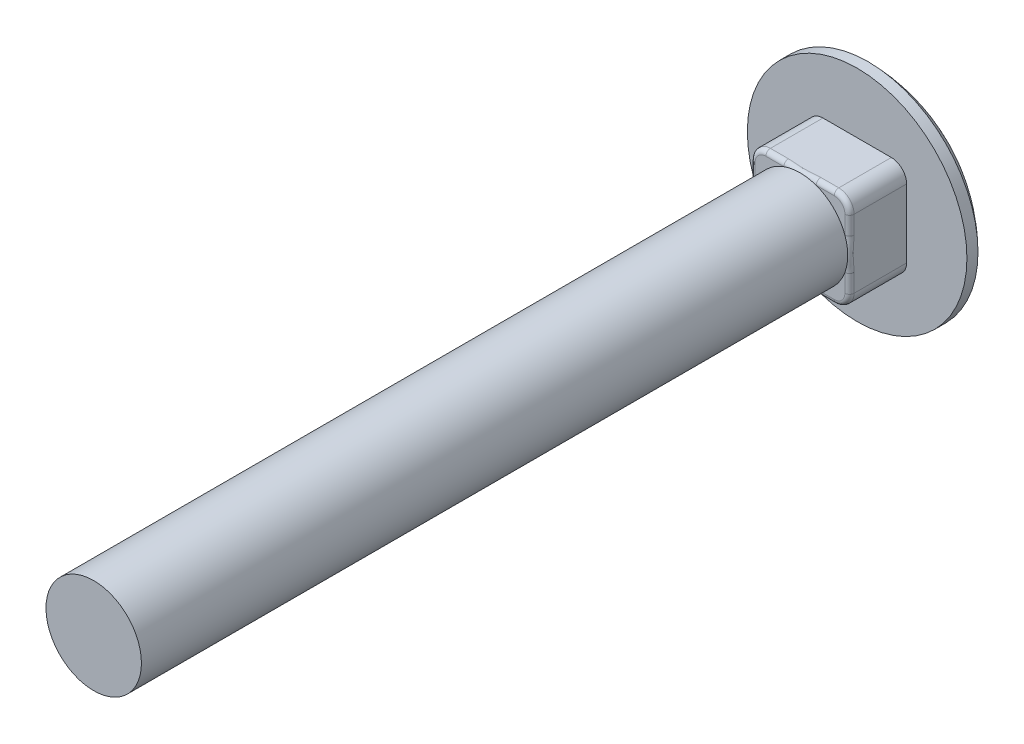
ISO-10303-21;
HEADER;
FILE_DESCRIPTION(('STEP AP214'),'2;1');
FILE_NAME('part.step','',(''),(''),'','','');
FILE_SCHEMA(('AUTOMOTIVE_DESIGN { 1 0 10303 214 1 1 1 1 }'));
ENDSEC;
DATA;
#1=APPLICATION_CONTEXT('core data for automotive mechanical design processes');
#2=APPLICATION_PROTOCOL_DEFINITION('international standard','automotive_design',2000,#1);
#3=PRODUCT_CONTEXT('',#1,'mechanical');
#4=PRODUCT('Part','Part','',(#3));
#5=PRODUCT_RELATED_PRODUCT_CATEGORY('part','',(#4));
#6=PRODUCT_DEFINITION_FORMATION('','',#4);
#7=PRODUCT_DEFINITION_CONTEXT('part definition',#1,'design');
#8=PRODUCT_DEFINITION('design','',#6,#7);
#9=PRODUCT_DEFINITION_SHAPE('','',#8);
#10=(LENGTH_UNIT() NAMED_UNIT(*) SI_UNIT(.MILLI.,.METRE.));
#11=(NAMED_UNIT(*) PLANE_ANGLE_UNIT() SI_UNIT($,.RADIAN.));
#12=(NAMED_UNIT(*) SI_UNIT($,.STERADIAN.) SOLID_ANGLE_UNIT());
#13=UNCERTAINTY_MEASURE_WITH_UNIT(LENGTH_MEASURE(1.E-05),#10,'distance_accuracy_value','');
#14=(GEOMETRIC_REPRESENTATION_CONTEXT(3) GLOBAL_UNCERTAINTY_ASSIGNED_CONTEXT((#13)) GLOBAL_UNIT_ASSIGNED_CONTEXT((#10,
#11,#12)) REPRESENTATION_CONTEXT('',''));
#15=CARTESIAN_POINT('',(0.,0.,0.));
#16=DIRECTION('',(0.,0.,1.));
#17=DIRECTION('',(1.,0.,0.));
#18=AXIS2_PLACEMENT_3D('',#15,#16,#17);
#19=CARTESIAN_POINT('',(-4.11480000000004,-4.1148,4.7498));
#20=DIRECTION('',(0.,0.,1.));
#21=DIRECTION('',(1.,0.,0.));
#22=AXIS2_PLACEMENT_3D('',#19,#20,#21);
#23=PLANE('',#22);
#24=CARTESIAN_POINT('',(2.84479999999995,-2.8448,4.7498));
#25=DIRECTION('',(0.,0.,1.));
#26=DIRECTION('',(1.,0.,0.));
#27=AXIS2_PLACEMENT_3D('',#24,#25,#26);
#28=CIRCLE('',#27,0.889);
#29=CARTESIAN_POINT('',(2.84479999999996,-3.7338,4.7498));
#30=VERTEX_POINT('',#29);
#31=CARTESIAN_POINT('',(3.73379999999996,-2.8448,4.7498));
#32=VERTEX_POINT('',#31);
#33=EDGE_CURVE('E505',#30,#32,#28,.T.);
#34=ORIENTED_EDGE('',*,*,#33,.T.);
#35=DIRECTION('',(0.,1.,0.));
#36=VECTOR('',#35,1.);
#37=CARTESIAN_POINT('',(3.73379999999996,2.8448,4.7498));
#38=LINE('',#37,#36);
#39=CARTESIAN_POINT('',(3.73379999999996,-1.34525615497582,4.7498));
#40=VERTEX_POINT('',#39);
#41=EDGE_CURVE('E506',#32,#40,#38,.T.);
#42=ORIENTED_EDGE('',*,*,#41,.T.);
#43=CARTESIAN_POINT('',(0.,0.,4.7498));
#44=DIRECTION('',(0.,0.,1.));
#45=DIRECTION('',(1.,0.,0.));
#46=AXIS2_PLACEMENT_3D('',#43,#44,#45);
#47=CIRCLE('',#46,3.96875);
#48=CARTESIAN_POINT('',(1.3452561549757,-3.7338,4.7498));
#49=VERTEX_POINT('',#48);
#50=EDGE_CURVE('E448',#49,#40,#47,.T.);
#51=ORIENTED_EDGE('',*,*,#50,.F.);
#52=DIRECTION('',(1.,0.,0.));
#53=VECTOR('',#52,1.);
#54=CARTESIAN_POINT('',(2.84479999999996,-3.7338,4.7498));
#55=LINE('',#54,#53);
#56=EDGE_CURVE('E503',#49,#30,#55,.T.);
#57=ORIENTED_EDGE('',*,*,#56,.T.);
#58=EDGE_LOOP('',(#34,#42,#51,#57));
#59=FACE_BOUND('',#58,.T.);
#60=ADVANCED_FACE('F38',(#59),#23,.T.);
#61=CARTESIAN_POINT('',(-2.84480000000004,-2.8448,4.7498));
#62=DIRECTION('',(0.,0.,1.));
#63=DIRECTION('',(1.,0.,0.));
#64=AXIS2_PLACEMENT_3D('',#61,#62,#63);
#65=CIRCLE('',#64,0.889);
#66=CARTESIAN_POINT('',(-3.73380000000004,-2.8448,4.7498));
#67=VERTEX_POINT('',#66);
#68=CARTESIAN_POINT('',(-2.84480000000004,-3.7338,4.7498));
#69=VERTEX_POINT('',#68);
#70=EDGE_CURVE('E499',#67,#69,#65,.T.);
#71=ORIENTED_EDGE('',*,*,#70,.T.);
#72=DIRECTION('',(1.,0.,0.));
#73=VECTOR('',#72,1.);
#74=CARTESIAN_POINT('',(2.84479999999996,-3.7338,4.7498));
#75=LINE('',#74,#73);
#76=CARTESIAN_POINT('',(-1.3452561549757,-3.7338,4.7498));
#77=VERTEX_POINT('',#76);
#78=EDGE_CURVE('E501',#69,#77,#75,.T.);
#79=ORIENTED_EDGE('',*,*,#78,.T.);
#80=CARTESIAN_POINT('',(-3.73380000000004,-1.34525615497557,4.7498));
#81=VERTEX_POINT('',#80);
#82=EDGE_CURVE('E586',#81,#77,#47,.T.);
#83=ORIENTED_EDGE('',*,*,#82,.F.);
#84=DIRECTION('',(0.,-1.,0.));
#85=VECTOR('',#84,1.);
#86=CARTESIAN_POINT('',(-3.73380000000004,-2.8448,4.7498));
#87=LINE('',#86,#85);
#88=EDGE_CURVE('E444',#81,#67,#87,.T.);
#89=ORIENTED_EDGE('',*,*,#88,.T.);
#90=EDGE_LOOP('',(#71,#79,#83,#89));
#91=FACE_BOUND('',#90,.T.);
#92=ADVANCED_FACE('F198',(#91),#23,.T.);
#93=CARTESIAN_POINT('',(-2.84480000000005,2.8448,4.7498));
#94=DIRECTION('',(0.,0.,1.));
#95=DIRECTION('',(1.,0.,0.));
#96=AXIS2_PLACEMENT_3D('',#93,#94,#95);
#97=CIRCLE('',#96,0.889);
#98=CARTESIAN_POINT('',(-2.84480000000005,3.7338,4.7498));
#99=VERTEX_POINT('',#98);
#100=CARTESIAN_POINT('',(-3.73380000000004,2.8448,4.7498));
#101=VERTEX_POINT('',#100);
#102=EDGE_CURVE('E495',#99,#101,#97,.T.);
#103=ORIENTED_EDGE('',*,*,#102,.T.);
#104=DIRECTION('',(0.,-1.,0.));
#105=VECTOR('',#104,1.);
#106=CARTESIAN_POINT('',(-3.73380000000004,-2.8448,4.7498));
#107=LINE('',#106,#105);
#108=CARTESIAN_POINT('',(-3.73380000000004,1.34525615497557,4.7498));
#109=VERTEX_POINT('',#108);
#110=EDGE_CURVE('E426',#101,#109,#107,.T.);
#111=ORIENTED_EDGE('',*,*,#110,.T.);
#112=CARTESIAN_POINT('',(-1.3452561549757,3.7338,4.7498));
#113=VERTEX_POINT('',#112);
#114=EDGE_CURVE('E583',#113,#109,#47,.T.);
#115=ORIENTED_EDGE('',*,*,#114,.F.);
#116=DIRECTION('',(-1.,0.,0.));
#117=VECTOR('',#116,1.);
#118=CARTESIAN_POINT('',(-2.84480000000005,3.7338,4.7498));
#119=LINE('',#118,#117);
#120=EDGE_CURVE('E244',#113,#99,#119,.T.);
#121=ORIENTED_EDGE('',*,*,#120,.T.);
#122=EDGE_LOOP('',(#103,#111,#115,#121));
#123=FACE_BOUND('',#122,.T.);
#124=ADVANCED_FACE('F205',(#123),#23,.T.);
#125=CARTESIAN_POINT('',(3.73379999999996,1.34525615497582,4.7498));
#126=VERTEX_POINT('',#125);
#127=CARTESIAN_POINT('',(1.3452561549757,3.7338,4.7498));
#128=VERTEX_POINT('',#127);
#129=EDGE_CURVE('E221',#126,#128,#47,.T.);
#130=ORIENTED_EDGE('',*,*,#129,.F.);
#131=DIRECTION('',(0.,1.,0.));
#132=VECTOR('',#131,1.);
#133=CARTESIAN_POINT('',(3.73379999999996,2.8448,4.7498));
#134=LINE('',#133,#132);
#135=CARTESIAN_POINT('',(3.73379999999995,2.8448,4.7498));
#136=VERTEX_POINT('',#135);
#137=EDGE_CURVE('E223',#126,#136,#134,.T.);
#138=ORIENTED_EDGE('',*,*,#137,.T.);
#139=CARTESIAN_POINT('',(2.84479999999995,2.8448,4.7498));
#140=DIRECTION('',(0.,0.,1.));
#141=DIRECTION('',(1.,0.,0.));
#142=AXIS2_PLACEMENT_3D('',#139,#140,#141);
#143=CIRCLE('',#142,0.889);
#144=CARTESIAN_POINT('',(2.84479999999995,3.7338,4.7498));
#145=VERTEX_POINT('',#144);
#146=EDGE_CURVE('E491',#136,#145,#143,.T.);
#147=ORIENTED_EDGE('',*,*,#146,.T.);
#148=DIRECTION('',(-1.,0.,0.));
#149=VECTOR('',#148,1.);
#150=CARTESIAN_POINT('',(-2.84480000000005,3.7338,4.7498));
#151=LINE('',#150,#149);
#152=EDGE_CURVE('E226',#145,#128,#151,.T.);
#153=ORIENTED_EDGE('',*,*,#152,.T.);
#154=EDGE_LOOP('',(#130,#138,#147,#153));
#155=FACE_BOUND('',#154,.T.);
#156=ADVANCED_FACE('F201',(#155),#23,.T.);
#157=CARTESIAN_POINT('',(0.,0.,0.));
#158=DIRECTION('',(0.,0.,-1.));
#159=DIRECTION('',(-1.,0.,0.));
#160=AXIS2_PLACEMENT_3D('',#157,#158,#159);
#161=PLANE('',#160);
#162=CARTESIAN_POINT('',(0.,0.,0.));
#163=DIRECTION('',(0.,0.,1.));
#164=DIRECTION('',(1.,0.,0.));
#165=AXIS2_PLACEMENT_3D('',#162,#163,#164);
#166=CIRCLE('',#165,9.1313);
#167=CARTESIAN_POINT('',(9.1313,0.,0.));
#168=VERTEX_POINT('',#167);
#169=EDGE_CURVE('E467',#168,#168,#166,.T.);
#170=ORIENTED_EDGE('',*,*,#169,.T.);
#171=EDGE_LOOP('',(#170));
#172=FACE_BOUND('',#171,.T.);
#173=DIRECTION('',(0.,-1.,0.));
#174=VECTOR('',#173,1.);
#175=CARTESIAN_POINT('',(-4.11480000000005,4.1148,0.));
#176=LINE('',#175,#174);
#177=CARTESIAN_POINT('',(-4.11480000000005,2.8448,0.));
#178=VERTEX_POINT('',#177);
#179=CARTESIAN_POINT('',(-4.11480000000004,-2.8448,0.));
#180=VERTEX_POINT('',#179);
#181=EDGE_CURVE('E453',#178,#180,#176,.T.);
#182=ORIENTED_EDGE('',*,*,#181,.F.);
#183=CARTESIAN_POINT('',(-2.84480000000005,2.8448,0.));
#184=DIRECTION('',(0.,0.,-1.));
#185=DIRECTION('',(-1.,0.,0.));
#186=AXIS2_PLACEMENT_3D('',#183,#184,#185);
#187=CIRCLE('',#186,1.27);
#188=CARTESIAN_POINT('',(-2.84480000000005,4.1148,0.));
#189=VERTEX_POINT('',#188);
#190=EDGE_CURVE('E413',#178,#189,#187,.T.);
#191=ORIENTED_EDGE('',*,*,#190,.T.);
#192=DIRECTION('',(-1.,0.,0.));
#193=VECTOR('',#192,1.);
#194=CARTESIAN_POINT('',(-4.11480000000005,4.1148,0.));
#195=LINE('',#194,#193);
#196=CARTESIAN_POINT('',(2.84479999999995,4.1148,0.));
#197=VERTEX_POINT('',#196);
#198=EDGE_CURVE('E461',#197,#189,#195,.T.);
#199=ORIENTED_EDGE('',*,*,#198,.F.);
#200=CARTESIAN_POINT('',(2.84479999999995,2.8448,0.));
#201=DIRECTION('',(0.,0.,-1.));
#202=DIRECTION('',(-1.,0.,0.));
#203=AXIS2_PLACEMENT_3D('',#200,#201,#202);
#204=CIRCLE('',#203,1.27);
#205=CARTESIAN_POINT('',(4.11479999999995,2.8448,0.));
#206=VERTEX_POINT('',#205);
#207=EDGE_CURVE('E489',#197,#206,#204,.T.);
#208=ORIENTED_EDGE('',*,*,#207,.T.);
#209=DIRECTION('',(0.,1.,0.));
#210=VECTOR('',#209,1.);
#211=CARTESIAN_POINT('',(4.11479999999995,4.1148,0.));
#212=LINE('',#211,#210);
#213=CARTESIAN_POINT('',(4.11479999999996,-2.8448,0.));
#214=VERTEX_POINT('',#213);
#215=EDGE_CURVE('E458',#214,#206,#212,.T.);
#216=ORIENTED_EDGE('',*,*,#215,.F.);
#217=CARTESIAN_POINT('',(2.84479999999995,-2.8448,0.));
#218=DIRECTION('',(0.,0.,-1.));
#219=DIRECTION('',(-1.,0.,0.));
#220=AXIS2_PLACEMENT_3D('',#217,#218,#219);
#221=CIRCLE('',#220,1.27);
#222=CARTESIAN_POINT('',(2.84479999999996,-4.1148,0.));
#223=VERTEX_POINT('',#222);
#224=EDGE_CURVE('E487',#214,#223,#221,.T.);
#225=ORIENTED_EDGE('',*,*,#224,.T.);
#226=DIRECTION('',(1.,0.,0.));
#227=VECTOR('',#226,1.);
#228=CARTESIAN_POINT('',(-4.11480000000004,-4.1148,0.));
#229=LINE('',#228,#227);
#230=CARTESIAN_POINT('',(-2.84480000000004,-4.1148,0.));
#231=VERTEX_POINT('',#230);
#232=EDGE_CURVE('E455',#231,#223,#229,.T.);
#233=ORIENTED_EDGE('',*,*,#232,.F.);
#234=CARTESIAN_POINT('',(-2.84480000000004,-2.8448,0.));
#235=DIRECTION('',(0.,0.,-1.));
#236=DIRECTION('',(-1.,0.,0.));
#237=AXIS2_PLACEMENT_3D('',#234,#235,#236);
#238=CIRCLE('',#237,1.27);
#239=EDGE_CURVE('E485',#231,#180,#238,.T.);
#240=ORIENTED_EDGE('',*,*,#239,.T.);
#241=EDGE_LOOP('',(#182,#191,#199,#208,#216,#225,#233,#240));
#242=FACE_BOUND('',#241,.T.);
#243=ADVANCED_FACE('F193',(#172,#242),#161,.F.);
#244=CARTESIAN_POINT('',(0.,0.,0.));
#245=DIRECTION('',(0.,0.,1.));
#246=DIRECTION('',(1.,0.,0.));
#247=AXIS2_PLACEMENT_3D('',#244,#245,#246);
#248=CYLINDRICAL_SURFACE('',#247,9.1313);
#249=ORIENTED_EDGE('',*,*,#169,.F.);
#250=EDGE_LOOP('',(#249));
#251=FACE_BOUND('',#250,.T.);
#252=CARTESIAN_POINT('',(0.,0.,-0.92075));
#253=DIRECTION('',(0.,0.,1.));
#254=DIRECTION('',(1.,0.,0.));
#255=AXIS2_PLACEMENT_3D('',#252,#253,#254);
#256=CIRCLE('',#255,9.1313);
#257=CARTESIAN_POINT('',(9.1313,0.,-0.92075));
#258=VERTEX_POINT('',#257);
#259=EDGE_CURVE('E464',#258,#258,#256,.T.);
#260=ORIENTED_EDGE('',*,*,#259,.T.);
#261=EDGE_LOOP('',(#260));
#262=FACE_BOUND('',#261,.T.);
#263=ADVANCED_FACE('F183',(#251,#262),#248,.T.);
#264=CARTESIAN_POINT('',(0.320228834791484,0.,8.22556209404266));
#265=DIRECTION('',(0.,-1.,0.));
#266=DIRECTION('',(1.,0.,0.));
#267=AXIS2_PLACEMENT_3D('',#264,#265,#266);
#268=CIRCLE('',#267,12.7);
#269=TRIMMED_CURVE('',#268,(PARAMETER_VALUE(-1.5960138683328)),
(PARAMETER_VALUE(1.5960138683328)),.T.,.PARAMETER.);
#270=CARTESIAN_POINT('',(0.,0.,8.22556209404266));
#271=DIRECTION('',(0.,0.,1.));
#272=AXIS1_PLACEMENT('',#270,#271);
#273=SURFACE_OF_REVOLUTION('',#269,#272);
#274=ORIENTED_EDGE('',*,*,#259,.F.);
#275=EDGE_LOOP('',(#274));
#276=FACE_BOUND('',#275,.T.);
#277=CARTESIAN_POINT('',(0.,0.,-4.4704));
#278=VERTEX_POINT('',#277);
#279=VERTEX_LOOP('',#278);
#280=FACE_BOUND('',#279,.T.);
#281=ADVANCED_FACE('F180',(#276,#280),#273,.T.);
#282=CARTESIAN_POINT('',(-4.11480000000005,4.1148,4.7498));
#283=DIRECTION('',(1.,0.,0.));
#284=DIRECTION('',(0.,1.,0.));
#285=AXIS2_PLACEMENT_3D('',#282,#283,#284);
#286=PLANE('',#285);
#287=DIRECTION('',(0.,0.,-1.));
#288=VECTOR('',#287,1.);
#289=CARTESIAN_POINT('',(-4.11480000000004,-2.8448,4.7498));
#290=LINE('',#289,#288);
#291=CARTESIAN_POINT('',(-4.11480000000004,-2.8448,4.3688));
#292=VERTEX_POINT('',#291);
#293=EDGE_CURVE('E417',#180,#292,#290,.F.);
#294=ORIENTED_EDGE('',*,*,#293,.T.);
#295=DIRECTION('',(0.,-1.,0.));
#296=VECTOR('',#295,1.);
#297=CARTESIAN_POINT('',(-4.11480000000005,2.8448,4.3688));
#298=LINE('',#297,#296);
#299=CARTESIAN_POINT('',(-4.11480000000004,-1.34525615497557,4.3688));
#300=VERTEX_POINT('',#299);
#301=EDGE_CURVE('E349',#292,#300,#298,.F.);
#302=ORIENTED_EDGE('',*,*,#301,.T.);
#303=CARTESIAN_POINT('',(-4.11480000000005,1.92293445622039,4.44690922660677));
#304=CARTESIAN_POINT('',(-4.11480000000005,1.84844319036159,4.66012462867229));
#305=CARTESIAN_POINT('',(-3.91665918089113,1.81269145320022,4.76245637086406));
#306=CARTESIAN_POINT('',(-3.71851836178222,1.77693971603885,4.86478811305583));
#307=CARTESIAN_POINT('',(-3.52832482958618,1.81711322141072,4.7498));
#308=CARTESIAN_POINT('',(-4.11480000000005,1.88940177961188,4.43525110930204));
#309=CARTESIAN_POINT('',(-4.11480000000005,1.82458174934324,4.64631769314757));
#310=CARTESIAN_POINT('',(-3.92337164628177,1.79196673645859,4.75128456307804));
#311=CARTESIAN_POINT('',(-3.73186903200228,1.75962883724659,4.85638033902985));
#312=CARTESIAN_POINT('',(-3.54122389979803,1.79207592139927,4.7498));
#313=CARTESIAN_POINT('',(-4.11480000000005,1.85532432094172,4.42536743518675));
#314=CARTESIAN_POINT('',(-4.11480000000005,1.7985193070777,4.63360252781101));
#315=CARTESIAN_POINT('',(-3.92977073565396,1.76897536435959,4.7406766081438));
#316=CARTESIAN_POINT('',(-3.74467840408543,1.73969987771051,4.84785481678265));
#317=CARTESIAN_POINT('',(-3.55420578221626,1.76620545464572,4.7498));
#318=CARTESIAN_POINT('',(-4.11480000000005,1.78650622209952,4.40854081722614));
#319=CARTESIAN_POINT('',(-4.11480000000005,1.74347635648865,4.61049035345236));
#320=CARTESIAN_POINT('',(-3.94198262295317,1.71962829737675,4.72078684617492));
#321=CARTESIAN_POINT('',(-3.76910043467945,1.69602869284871,4.83118750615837));
#322=CARTESIAN_POINT('',(-3.58010796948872,1.71308665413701,4.7498));
#323=CARTESIAN_POINT('',(-4.11480000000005,1.75176689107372,4.40159259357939));
#324=CARTESIAN_POINT('',(-4.11480000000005,1.71450108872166,4.60005254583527));
#325=CARTESIAN_POINT('',(-3.94779645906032,1.69327875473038,4.71150267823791));
#326=CARTESIAN_POINT('',(-3.78074100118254,1.67230880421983,4.82303192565));
#327=CARTESIAN_POINT('',(-3.5930283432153,1.68584089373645,4.7498));
#328=CARTESIAN_POINT('',(-4.11480000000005,1.6822396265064,4.3900429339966));
#329=CARTESIAN_POINT('',(-4.11480000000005,1.6549513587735,4.58144696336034));
#330=CARTESIAN_POINT('',(-3.95885256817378,1.63854692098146,4.69449359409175));
#331=CARTESIAN_POINT('',(-3.80285526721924,1.62239389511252,4.8076176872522));
#332=CARTESIAN_POINT('',(-3.61851402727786,1.63041647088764,4.7498));
#333=CARTESIAN_POINT('',(-4.11480000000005,1.64745489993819,4.38542108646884));
#334=CARTESIAN_POINT('',(-4.11480000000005,1.6243837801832,4.57323187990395));
#335=CARTESIAN_POINT('',(-3.96409948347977,1.61018489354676,4.68675548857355));
#336=CARTESIAN_POINT('',(-3.81335785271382,1.59622490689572,4.80033740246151));
#337=CARTESIAN_POINT('',(-3.63108147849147,1.60224831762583,4.7498));
#338=CARTESIAN_POINT('',(-4.11480000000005,1.57769475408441,4.37802776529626));
#339=CARTESIAN_POINT('',(-4.11480000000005,1.56197178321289,4.55869082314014));
#340=CARTESIAN_POINT('',(-3.97412867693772,1.55179985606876,4.67264917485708));
#341=CARTESIAN_POINT('',(-3.83341686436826,1.54186408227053,4.78666400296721));
#342=CARTESIAN_POINT('',(-3.65585937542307,1.54487723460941,4.7498));
#343=CARTESIAN_POINT('',(-4.11480000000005,1.54271933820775,4.37525625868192));
#344=CARTESIAN_POINT('',(-4.11480000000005,1.53011129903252,4.55234341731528));
#345=CARTESIAN_POINT('',(-3.97891096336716,1.52177687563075,4.66628094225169));
#346=CARTESIAN_POINT('',(-3.84298942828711,1.51366562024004,4.78025792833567));
#347=CARTESIAN_POINT('',(-3.6680698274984,1.51567432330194,4.7498));
#348=CARTESIAN_POINT('',(-4.11480000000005,1.42446188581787,4.36843048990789));
#349=CARTESIAN_POINT('',(-4.11480000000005,1.42158530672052,4.53377995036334));
#350=CARTESIAN_POINT('',(-3.99435088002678,1.41832323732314,4.64689981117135));
#351=CARTESIAN_POINT('',(-3.87371427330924,1.41630468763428,4.76025814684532));
#352=CARTESIAN_POINT('',(-3.70853568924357,1.41545656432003,4.7498));
#353=CARTESIAN_POINT('',(-4.11480000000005,1.34098502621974,4.36786573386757));
#354=CARTESIAN_POINT('',(-4.11480000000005,1.34218416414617,4.5251527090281));
#355=CARTESIAN_POINT('',(-4.00403019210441,1.34205214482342,4.63681344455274));
#356=CARTESIAN_POINT('',(-3.8931439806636,1.34295149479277,4.74857654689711));
#357=CARTESIAN_POINT('',(-3.73573040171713,1.34224358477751,4.7498));
#358=CARTESIAN_POINT('',(-4.11480000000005,1.17414361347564,4.37192356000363));
#359=CARTESIAN_POINT('',(-4.11480000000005,1.18126790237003,4.51433166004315));
#360=CARTESIAN_POINT('',(-4.02138988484,1.18566018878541,4.62193866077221));
#361=CARTESIAN_POINT('',(-3.92786782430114,1.1910780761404,4.72963898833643));
#362=CARTESIAN_POINT('',(-3.78657101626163,1.19130879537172,4.7498));
#363=CARTESIAN_POINT('',(-4.11480000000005,1.09077932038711,4.37655245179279));
#364=CARTESIAN_POINT('',(-4.11480000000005,1.09951281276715,4.51204408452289));
#365=CARTESIAN_POINT('',(-4.02906782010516,1.10553475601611,4.61715670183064));
#366=CARTESIAN_POINT('',(-3.94326795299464,1.11236881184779,4.72229960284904));
#367=CARTESIAN_POINT('',(-3.8102125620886,1.1135816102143,4.7498));
#368=CARTESIAN_POINT('',(-4.11480000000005,0.923970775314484,4.38855341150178));
#369=CARTESIAN_POINT('',(-4.11480000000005,0.934647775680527,4.51144737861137));
#370=CARTESIAN_POINT('',(-4.04264532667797,0.942545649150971,4.61117739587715));
#371=CARTESIAN_POINT('',(-3.97042339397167,0.951251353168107,4.7109365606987));
#372=CARTESIAN_POINT('',(-3.85326852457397,0.954016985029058,4.7498));
#373=CARTESIAN_POINT('',(-4.11480000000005,0.840527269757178,4.39593505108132));
#374=CARTESIAN_POINT('',(-4.11480000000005,0.851312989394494,4.51311194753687));
#375=CARTESIAN_POINT('',(-4.04853856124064,0.859673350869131,4.60999268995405));
#376=CARTESIAN_POINT('',(-3.98224048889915,0.868638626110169,4.706875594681));
#377=CARTESIAN_POINT('',(-3.87266781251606,0.872166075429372,4.7498));
#378=CARTESIAN_POINT('',(-4.11480000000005,0.673718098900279,4.41115470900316));
#379=CARTESIAN_POINT('',(-4.11480000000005,0.683997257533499,4.51825228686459));
#380=CARTESIAN_POINT('',(-4.05861892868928,0.692210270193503,4.60964231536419));
#381=CARTESIAN_POINT('',(-4.0024019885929,0.701022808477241,4.70103270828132));
#382=CARTESIAN_POINT('',(-3.90651166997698,0.705259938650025,4.7498));
#383=CARTESIAN_POINT('',(-4.11480000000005,0.590352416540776,4.41899256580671));
#384=CARTESIAN_POINT('',(-4.11480000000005,0.599813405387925,4.52172086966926));
#385=CARTESIAN_POINT('',(-4.06280666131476,0.607620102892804,4.61047593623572));
#386=CARTESIAN_POINT('',(-4.0107974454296,0.615829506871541,4.69922645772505));
#387=CARTESIAN_POINT('',(-3.92095798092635,0.620205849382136,4.7498));
#388=CARTESIAN_POINT('',(-4.11480000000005,0.422811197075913,4.43295373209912));
#389=CARTESIAN_POINT('',(-4.11480000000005,0.430273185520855,4.52845913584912));
#390=CARTESIAN_POINT('',(-4.06954770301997,0.436479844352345,4.61266921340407));
#391=CARTESIAN_POINT('',(-4.02427943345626,0.44309239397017,4.69687347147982));
#392=CARTESIAN_POINT('',(-3.94448024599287,0.446934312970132,4.7498));
#393=CARTESIAN_POINT('',(-4.11480000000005,0.338634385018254,4.4390633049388));
#394=CARTESIAN_POINT('',(-4.11480000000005,0.344709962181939,4.53173630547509));
#395=CARTESIAN_POINT('',(-4.07208811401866,0.349919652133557,4.6140328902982));
#396=CARTESIAN_POINT('',(-4.02937222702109,0.355334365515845,4.69632768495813));
#397=CARTESIAN_POINT('',(-3.95351377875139,0.35869748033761,4.7498));
#398=CARTESIAN_POINT('',(-4.11480000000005,0.170097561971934,4.44750725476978));
#399=CARTESIAN_POINT('',(-4.11480000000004,0.173332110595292,4.53634460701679));
#400=CARTESIAN_POINT('',(-4.07548286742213,0.176048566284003,4.61602911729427));
#401=CARTESIAN_POINT('',(-4.03616174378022,0.178969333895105,4.69571071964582));
#402=CARTESIAN_POINT('',(-3.96563093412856,0.180796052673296,4.7498));
#403=CARTESIAN_POINT('',(-4.11480000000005,0.0857376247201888,4.44984294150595));
#404=CARTESIAN_POINT('',(-4.11480000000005,0.0873179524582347,4.53768636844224));
#405=CARTESIAN_POINT('',(-4.07633779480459,0.0887379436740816,4.61666192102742));
#406=CARTESIAN_POINT('',(-4.03787555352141,0.0901585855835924,4.69563754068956));
#407=CARTESIAN_POINT('',(-3.96871662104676,0.0911319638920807,4.7498));
#408=CARTESIAN_POINT('',(-4.11480000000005,-0.0828427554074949,4.44989164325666));
#409=CARTESIAN_POINT('',(-4.11480000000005,-0.0843686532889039,4.53771390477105));
#410=CARTESIAN_POINT('',(-4.07635612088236,-0.085741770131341,4.61667469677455));
#411=CARTESIAN_POINT('',(-4.03791227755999,-0.0871133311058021,4.69563542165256));
#412=CARTESIAN_POINT('',(-3.96878278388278,-0.0880549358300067,4.7498));
#413=CARTESIAN_POINT('',(-4.11480000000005,-0.1670631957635,4.4476123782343));
#414=CARTESIAN_POINT('',(-4.11480000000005,-0.170241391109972,4.5364041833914));
#415=CARTESIAN_POINT('',(-4.07552234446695,-0.172910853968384,4.61605676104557));
#416=CARTESIAN_POINT('',(-4.03624094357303,-0.175781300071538,4.69570623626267));
#417=CARTESIAN_POINT('',(-3.9657734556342,-0.177577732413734,4.7498));
#418=CARTESIAN_POINT('',(-4.11480000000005,-0.335323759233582,4.43927482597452));
#419=CARTESIAN_POINT('',(-4.11480000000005,-0.341345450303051,4.53184989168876));
#420=CARTESIAN_POINT('',(-4.07217566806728,-0.346511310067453,4.61408034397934));
#421=CARTESIAN_POINT('',(-4.02954731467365,-0.351879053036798,4.69630931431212));
#422=CARTESIAN_POINT('',(-3.95382472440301,-0.35521765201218,4.7498));
#423=CARTESIAN_POINT('',(-4.11480000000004,-0.419363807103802,4.43321518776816));
#424=CARTESIAN_POINT('',(-4.11480000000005,-0.426775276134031,4.5285947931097));
#425=CARTESIAN_POINT('',(-4.06966216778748,-0.432942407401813,4.61272159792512));
#426=CARTESIAN_POINT('',(-4.0245081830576,-0.439511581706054,4.6968435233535));
#427=CARTESIAN_POINT('',(-3.94488320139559,-0.443334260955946,4.7498));
#428=CARTESIAN_POINT('',(-4.11480000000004,-0.550039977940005,4.42236552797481));
#429=CARTESIAN_POINT('',(-4.11480000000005,-0.558886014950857,4.52334946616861));
#430=CARTESIAN_POINT('',(-4.06444134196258,-0.566450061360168,4.61100000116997));
#431=CARTESIAN_POINT('',(-4.01407802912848,-0.574139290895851,4.69864875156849));
#432=CARTESIAN_POINT('',(-3.92666024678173,-0.578532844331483,4.7498));
#433=CARTESIAN_POINT('',(-4.11480000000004,-0.59673409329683,4.41820438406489));
#434=CARTESIAN_POINT('',(-4.11480000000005,-0.606072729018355,4.52143330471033));
#435=CARTESIAN_POINT('',(-4.06231440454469,-0.613979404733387,4.61046272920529));
#436=CARTESIAN_POINT('',(-4.0098208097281,-0.622045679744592,4.69949096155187));
#437=CARTESIAN_POINT('',(-3.91928843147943,-0.626481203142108,4.7498));
#438=CARTESIAN_POINT('',(-4.11480000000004,-0.690114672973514,4.40970830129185));
#439=CARTESIAN_POINT('',(-4.11480000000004,-0.700167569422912,4.5178752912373));
#440=CARTESIAN_POINT('',(-4.05753341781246,-0.708564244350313,4.60980522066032));
#441=CARTESIAN_POINT('',(-4.00025867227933,-0.717121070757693,4.70173411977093));
#442=CARTESIAN_POINT('',(-3.90291844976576,-0.721474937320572,4.7498));
#443=CARTESIAN_POINT('',(-4.11480000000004,-0.736801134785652,4.40537333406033));
#444=CARTESIAN_POINT('',(-4.11480000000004,-0.747110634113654,4.51623305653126));
#445=CARTESIAN_POINT('',(-4.05487928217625,-0.755619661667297,4.60968505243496));
#446=CARTESIAN_POINT('',(-3.99494637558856,-0.764323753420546,4.70313791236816));
#447=CARTESIAN_POINT('',(-3.89392001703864,-0.768520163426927,4.7498));
#448=CARTESIAN_POINT('',(-4.11480000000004,-0.830271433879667,4.39691504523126));
#449=CARTESIAN_POINT('',(-4.11480000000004,-0.840747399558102,4.51357881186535));
#450=CARTESIAN_POINT('',(-4.04902850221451,-0.849235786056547,4.61013040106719));
#451=CARTESIAN_POINT('',(-3.98324471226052,-0.85792081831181,4.70668299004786));
#452=CARTESIAN_POINT('',(-3.8743770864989,-0.861653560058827,4.7498));
#453=CARTESIAN_POINT('',(-4.11480000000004,-0.87705530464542,4.39279208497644));
#454=CARTESIAN_POINT('',(-4.11480000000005,-0.887476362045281,4.51256946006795));
#455=CARTESIAN_POINT('',(-4.04583096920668,-0.895795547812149,4.61069705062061));
#456=CARTESIAN_POINT('',(-3.97684443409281,-0.904347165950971,4.70882999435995));
#457=CARTESIAN_POINT('',(-3.86383005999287,-0.907740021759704,4.7498));
#458=CARTESIAN_POINT('',(-4.11480000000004,-0.970672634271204,4.38516730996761));
#459=CARTESIAN_POINT('',(-4.11480000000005,-0.980535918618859,4.51156015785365));
#460=CARTESIAN_POINT('',(-4.03887845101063,-0.988219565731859,4.61279932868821));
#461=CARTESIAN_POINT('',(-3.96293935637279,-0.996136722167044,4.7140437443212));
#462=CARTESIAN_POINT('',(-3.84130809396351,-0.998762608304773,4.7498));
#463=CARTESIAN_POINT('',(-4.11480000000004,-1.01750609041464,4.381665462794));
#464=CARTESIAN_POINT('',(-4.11480000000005,-1.02690412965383,4.5115648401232));
#465=CARTESIAN_POINT('',(-4.03512349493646,-1.03408385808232,4.61433490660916));
#466=CARTESIAN_POINT('',(-3.95542309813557,-1.0415336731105,4.71711732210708));
#467=CARTESIAN_POINT('',(-3.82933322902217,-1.04369879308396,4.7498));
#468=CARTESIAN_POINT('',(-4.11480000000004,-1.12744404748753,4.37466368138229));
#469=CARTESIAN_POINT('',(-4.11480000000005,-1.13518605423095,4.51322102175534));
#470=CARTESIAN_POINT('',(-4.0256309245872,-1.14065900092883,4.61941412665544));
#471=CARTESIAN_POINT('',(-3.93641770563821,-1.14662505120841,4.72563144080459));
#472=CARTESIAN_POINT('',(-3.79970544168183,-1.14763146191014,4.7498));
#473=CARTESIAN_POINT('',(-4.11480000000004,-1.19057711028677,4.37158281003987));
#474=CARTESIAN_POINT('',(-4.11480000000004,-1.19686658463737,4.51545842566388));
#475=CARTESIAN_POINT('',(-4.01965662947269,-1.20102182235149,4.62346840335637));
#476=CARTESIAN_POINT('',(-3.92444892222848,-1.20576268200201,4.73153250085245));
#477=CARTESIAN_POINT('',(-3.78152060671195,-1.20611902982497,4.7498));
#478=CARTESIAN_POINT('',(-4.11480000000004,-1.31685076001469,4.36839693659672));
#479=CARTESIAN_POINT('',(-4.11480000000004,-1.31870320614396,4.52349988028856));
#480=CARTESIAN_POINT('',(-4.00656336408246,-1.31947005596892,4.63460113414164));
#481=CARTESIAN_POINT('',(-3.89826124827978,-1.32082563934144,4.74575865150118));
#482=CARTESIAN_POINT('',(-3.74312479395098,-1.32046321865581,4.7498));
#483=CARTESIAN_POINT('',(-4.11480000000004,-1.37999119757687,4.36828753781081));
#484=CARTESIAN_POINT('',(-4.11480000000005,-1.37896416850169,4.52934205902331));
#485=CARTESIAN_POINT('',(-3.99944610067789,-1.37755870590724,4.64167510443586));
#486=CARTESIAN_POINT('',(-3.88399788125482,-1.37683492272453,4.75411812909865));
#487=CARTESIAN_POINT('',(-3.72291685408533,-1.37632360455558,4.7498));
#488=CARTESIAN_POINT('',(-4.11480000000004,-1.47941785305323,4.37152149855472));
#489=CARTESIAN_POINT('',(-4.11480000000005,-1.47177021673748,4.54225813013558));
#490=CARTESIAN_POINT('',(-3.98720207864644,-1.46645809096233,4.65582921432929));
#491=CARTESIAN_POINT('',(-3.85957294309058,-1.46137442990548,4.76943583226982));
#492=CARTESIAN_POINT('',(-3.68976966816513,-1.46209027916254,4.7498));
#493=CARTESIAN_POINT('',(-4.11480000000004,-1.51574851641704,4.37342173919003));
#494=CARTESIAN_POINT('',(-4.11480000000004,-1.50540660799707,4.54780063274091));
#495=CARTESIAN_POINT('',(-3.98250943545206,-1.49839945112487,4.66163712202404));
#496=CARTESIAN_POINT('',(-3.85018014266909,-1.49163699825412,4.77552456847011));
#497=CARTESIAN_POINT('',(-3.67737792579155,-1.49296628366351,4.7498));
#498=CARTESIAN_POINT('',(-4.11480000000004,-1.58825773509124,4.3789918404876));
#499=CARTESIAN_POINT('',(-4.11480000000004,-1.57151230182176,4.56072098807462));
#500=CARTESIAN_POINT('',(-3.97265387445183,-1.56076020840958,4.67465555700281));
#501=CARTESIAN_POINT('',(-3.83046874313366,-1.55025527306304,4.78864185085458));
#502=CARTESIAN_POINT('',(-3.65215378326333,-1.5536500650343,4.7498));
#503=CARTESIAN_POINT('',(-4.11480000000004,-1.62443636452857,4.38266070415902));
#504=CARTESIAN_POINT('',(-4.11480000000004,-1.60400157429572,4.56811797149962));
#505=CARTESIAN_POINT('',(-3.96749122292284,-1.59118045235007,4.68186529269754));
#506=CARTESIAN_POINT('',(-3.82013478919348,-1.5786222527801,4.79568300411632));
#507=CARTESIAN_POINT('',(-3.63932163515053,-1.58345843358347,4.7498));
#508=CARTESIAN_POINT('',(-4.11480000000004,-1.69671491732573,4.39218734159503));
#509=CARTESIAN_POINT('',(-4.11480000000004,-1.66752276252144,4.58506805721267));
#510=CARTESIAN_POINT('',(-3.95661637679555,-1.65015954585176,4.69785878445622));
#511=CARTESIAN_POINT('',(-3.79838334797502,-1.6330597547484,4.81072186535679));
#512=CARTESIAN_POINT('',(-3.61325785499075,-1.64206431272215,4.7498));
#513=CARTESIAN_POINT('',(-4.11480000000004,-1.73281342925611,4.398056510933));
#514=CARTESIAN_POINT('',(-4.11480000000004,-1.69856134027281,4.59465950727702));
#515=CARTESIAN_POINT('',(-3.9509014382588,-1.6787077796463,4.70665060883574));
#516=CARTESIAN_POINT('',(-3.7869408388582,-1.65912093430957,4.81873985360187));
#517=CARTESIAN_POINT('',(-3.60002447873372,-1.6708556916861,4.7498));
#518=CARTESIAN_POINT('',(-4.11480000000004,-1.80451514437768,4.4125797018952));
#519=CARTESIAN_POINT('',(-4.11480000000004,-1.75814099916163,4.61618380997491));
#520=CARTESIAN_POINT('',(-3.93887481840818,-1.73285444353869,4.7257524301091));
#521=CARTESIAN_POINT('',(-3.76288953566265,-1.70785122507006,4.83541690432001));
#522=CARTESIAN_POINT('',(-3.57337813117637,-1.72711447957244,4.7498));
#523=CARTESIAN_POINT('',(-4.11480000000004,-1.84011716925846,4.42123945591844));
#524=CARTESIAN_POINT('',(-4.11480000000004,-1.78668431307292,4.62815761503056));
#525=CARTESIAN_POINT('',(-3.93256192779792,-1.75844665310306,4.73606552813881));
#526=CARTESIAN_POINT('',(-3.75025292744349,-1.73050546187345,4.84409317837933));
#527=CARTESIAN_POINT('',(-3.55996484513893,-1.75457902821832,4.7498));
#528=CARTESIAN_POINT('',(-4.11480000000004,-1.87528315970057,4.43158323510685));
#529=CARTESIAN_POINT('',(-4.11480000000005,-1.81329911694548,4.64133467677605));
#530=CARTESIAN_POINT('',(-3.92592659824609,-1.78204246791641,4.74710588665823));
#531=CARTESIAN_POINT('',(-3.73705319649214,-1.75078581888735,4.8528770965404));
#532=CARTESIAN_POINT('',(-3.54656708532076,-1.78124632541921,4.7498));
#533=(BOUNDED_SURFACE() B_SPLINE_SURFACE(3,2,((#303,#304,#305,#306,#307),(#308,#309,#310,#311,
#312),(#313,#314,#315,#316,#317),(#318,#319,#320,#321,#322),(#323,#324,#325,#326,#327),(#328,
#329,#330,#331,#332),(#333,#334,#335,#336,#337),(#338,#339,#340,#341,#342),(#343,#344,#345,#346,
#347),(#348,#349,#350,#351,#352),(#353,#354,#355,#356,#357),(#358,#359,#360,#361,#362),(#363,
#364,#365,#366,#367),(#368,#369,#370,#371,#372),(#373,#374,#375,#376,#377),(#378,#379,#380,#381,
#382),(#383,#384,#385,#386,#387),(#388,#389,#390,#391,#392),(#393,#394,#395,#396,#397),(#398,
#399,#400,#401,#402),(#403,#404,#405,#406,#407),(#408,#409,#410,#411,#412),(#413,#414,#415,#416,
#417),(#418,#419,#420,#421,#422),(#423,#424,#425,#426,#427),(#428,#429,#430,#431,#432),(#433,
#434,#435,#436,#437),(#438,#439,#440,#441,#442),(#443,#444,#445,#446,#447),(#448,#449,#450,#451,
#452),(#453,#454,#455,#456,#457),(#458,#459,#460,#461,#462),(#463,#464,#465,#466,#467),(#468,
#469,#470,#471,#472),(#473,#474,#475,#476,#477),(#478,#479,#480,#481,#482),(#483,#484,#485,#486,
#487),(#488,#489,#490,#491,#492),(#493,#494,#495,#496,#497),(#498,#499,#500,#501,#502),(#503,
#504,#505,#506,#507),(#508,#509,#510,#511,#512),(#513,#514,#515,#516,#517),(#518,#519,#520,#521,
#522),(#523,#524,#525,#526,#527),(#528,#529,#530,#531,#532)),.UNSPECIFIED.,.F.,.F.,
.F.) B_SPLINE_SURFACE_WITH_KNOTS((4,2,2,2,2,2,2,2,2,2,2,2,2,2,2,2,2,2,2,2,2,2,4),(3,2,3),(0.,
0.106358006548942,0.212523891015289,0.317741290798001,0.42295681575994,0.67306615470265,
0.923479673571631,1.17477215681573,1.42597619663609,1.67912407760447,1.93218408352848,
2.18482111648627,2.43754848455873,2.57818703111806,2.71884862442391,2.85974251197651,
3.00062904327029,3.19021429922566,3.37951902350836,3.48862521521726,3.59766997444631,
3.70728746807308,3.81713158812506),(0.,0.5,1.),
.UNSPECIFIED.) GEOMETRIC_REPRESENTATION_ITEM() RATIONAL_B_SPLINE_SURFACE(((1.,0.860216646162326,
1.,0.860216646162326,1.),(1.,0.865335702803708,1.,0.865335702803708,1.),(1.,0.870172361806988,
1.,0.870172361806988,1.),(1.,0.879333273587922,1.,0.879333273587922,1.),(1.,0.883658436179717,
1.,0.883658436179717,1.),(1.,0.891830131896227,1.,0.891830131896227,1.),(1.,0.895680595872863,
1.,0.895680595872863,1.),(1.,0.902997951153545,1.,0.902997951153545,1.),(1.,0.906464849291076,
1.,0.906464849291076,1.),(1.,0.917601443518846,1.,0.917601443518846,1.),(1.,0.924484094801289,
1.,0.924484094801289,1.),(1.,0.936723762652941,1.,0.936723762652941,1.),(1.,0.942078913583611,
1.,0.942078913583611,1.),(1.,0.951488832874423,1.,0.951488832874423,1.),(1.,0.955538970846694,
1.,0.955538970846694,1.),(1.,0.96243615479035,1.,0.96243615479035,1.),(1.,0.965283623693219,1.,
0.965283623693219,1.),(1.,0.969855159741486,1.,0.969855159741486,1.),(1.,0.971570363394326,1.,
0.971570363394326,1.),(1.,0.973860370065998,1.,0.973860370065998,1.),(1.,0.974435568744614,1.,
0.974435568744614,1.),(1.,0.974447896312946,1.,0.974447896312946,1.),(1.,0.973886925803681,1.,
0.973886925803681,1.),(1.,0.971629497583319,1.,0.971629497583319,1.),(1.,0.969932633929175,1.,
0.969932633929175,1.),(1.,0.966392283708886,1.,0.966392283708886,1.),(1.,0.964947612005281,1.,
0.964947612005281,1.),(1.,0.961691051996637,1.,0.961691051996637,1.),(1.,0.959879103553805,1.,
0.959879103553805,1.),(1.,0.955871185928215,1.,0.955871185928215,1.),(1.,0.953674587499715,1.,
0.953674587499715,1.),(1.,0.94887889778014,1.,0.94887889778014,1.),(1.,0.946279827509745,1.,
0.946279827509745,1.),(1.,0.9396779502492,1.,0.9396779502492,1.),(1.,0.935500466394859,1.,
0.935500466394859,1.),(1.,0.926271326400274,1.,0.926271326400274,1.),(1.,0.921220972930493,1.,
0.921220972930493,1.),(1.,0.912446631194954,1.,0.912446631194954,1.),(1.,0.909067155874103,1.,
0.909067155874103,1.),(1.,0.90192531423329,1.,0.90192531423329,1.),(1.,0.898163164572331,1.,
0.898163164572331,1.),(1.,0.890183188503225,1.,0.890183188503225,1.),(1.,0.885963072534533,1.,
0.885963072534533,1.),(1.,0.877010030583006,1.,0.877010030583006,1.),(1.,0.872276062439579,1.,
0.872276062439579,1.),(1.,0.867256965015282,1.,0.867256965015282,1.))) REPRESENTATION_ITEM('') SURFACE());
#534=CARTESIAN_POINT('',(-4.11480000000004,-1.87528315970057,4.43158323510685));
#535=CARTESIAN_POINT('',(-4.11480000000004,-1.84011716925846,4.42123945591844));
#536=CARTESIAN_POINT('',(-4.11480000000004,-1.80451514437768,4.4125797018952));
#537=CARTESIAN_POINT('',(-4.11480000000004,-1.73281342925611,4.398056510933));
#538=CARTESIAN_POINT('',(-4.11480000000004,-1.69671491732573,4.39218734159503));
#539=CARTESIAN_POINT('',(-4.11480000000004,-1.62443636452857,4.38266070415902));
#540=CARTESIAN_POINT('',(-4.11480000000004,-1.58825773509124,4.3789918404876));
#541=CARTESIAN_POINT('',(-4.11480000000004,-1.51574851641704,4.37342173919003));
#542=CARTESIAN_POINT('',(-4.11480000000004,-1.47941785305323,4.37152149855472));
#543=CARTESIAN_POINT('',(-4.11480000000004,-1.37999119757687,4.36828753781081));
#544=CARTESIAN_POINT('',(-4.11480000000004,-1.31685076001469,4.36839693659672));
#545=CARTESIAN_POINT('',(-4.11480000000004,-1.19057711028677,4.37158281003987));
#546=CARTESIAN_POINT('',(-4.11480000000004,-1.12744404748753,4.37466368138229));
#547=CARTESIAN_POINT('',(-4.11480000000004,-1.01750609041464,4.381665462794));
#548=CARTESIAN_POINT('',(-4.11480000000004,-0.970672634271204,4.38516730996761));
#549=CARTESIAN_POINT('',(-4.11480000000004,-0.87705530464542,4.39279208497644));
#550=CARTESIAN_POINT('',(-4.11480000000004,-0.830271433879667,4.39691504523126));
#551=CARTESIAN_POINT('',(-4.11480000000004,-0.736801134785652,4.40537333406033));
#552=CARTESIAN_POINT('',(-4.11480000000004,-0.690114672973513,4.40970830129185));
#553=CARTESIAN_POINT('',(-4.11480000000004,-0.59673409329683,4.41820438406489));
#554=CARTESIAN_POINT('',(-4.11480000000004,-0.550039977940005,4.42236552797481));
#555=CARTESIAN_POINT('',(-4.11480000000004,-0.419363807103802,4.43321518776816));
#556=CARTESIAN_POINT('',(-4.11480000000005,-0.335323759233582,4.43927482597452));
#557=CARTESIAN_POINT('',(-4.11480000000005,-0.1670631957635,4.4476123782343));
#558=CARTESIAN_POINT('',(-4.11480000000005,-0.082842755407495,4.44989164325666));
#559=CARTESIAN_POINT('',(-4.11480000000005,0.0857376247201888,4.44984294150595));
#560=CARTESIAN_POINT('',(-4.11480000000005,0.170097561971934,4.44750725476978));
#561=CARTESIAN_POINT('',(-4.11480000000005,0.338634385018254,4.4390633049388));
#562=CARTESIAN_POINT('',(-4.11480000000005,0.422811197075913,4.43295373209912));
#563=CARTESIAN_POINT('',(-4.11480000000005,0.590352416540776,4.41899256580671));
#564=CARTESIAN_POINT('',(-4.11480000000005,0.673718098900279,4.41115470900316));
#565=CARTESIAN_POINT('',(-4.11480000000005,0.840527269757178,4.39593505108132));
#566=CARTESIAN_POINT('',(-4.11480000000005,0.923970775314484,4.38855341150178));
#567=CARTESIAN_POINT('',(-4.11480000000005,1.09077932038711,4.37655245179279));
#568=CARTESIAN_POINT('',(-4.11480000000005,1.17414361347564,4.37192356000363));
#569=CARTESIAN_POINT('',(-4.11480000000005,1.34098502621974,4.36786573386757));
#570=CARTESIAN_POINT('',(-4.11480000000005,1.42446188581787,4.36843048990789));
#571=CARTESIAN_POINT('',(-4.11480000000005,1.54271933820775,4.37525625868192));
#572=CARTESIAN_POINT('',(-4.11480000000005,1.57769475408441,4.37802776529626));
#573=CARTESIAN_POINT('',(-4.11480000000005,1.64745489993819,4.38542108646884));
#574=CARTESIAN_POINT('',(-4.11480000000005,1.6822396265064,4.3900429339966));
#575=CARTESIAN_POINT('',(-4.11480000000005,1.75176689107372,4.40159259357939));
#576=CARTESIAN_POINT('',(-4.11480000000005,1.78650622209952,4.40854081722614));
#577=CARTESIAN_POINT('',(-4.11480000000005,1.85532432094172,4.42536743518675));
#578=CARTESIAN_POINT('',(-4.11480000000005,1.88940177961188,4.43525110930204));
#579=CARTESIAN_POINT('',(-4.11480000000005,1.92293445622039,4.44690922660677));
#580=B_SPLINE_CURVE_WITH_KNOTS('',3,(#534,#535,#536,#537,#538,#539,#540,#541,#542,#543,#544,
#545,#546,#547,#548,#549,#550,#551,#552,#553,#554,#555,#556,#557,#558,#559,#560,#561,#562,#563,
#564,#565,#566,#567,#568,#569,#570,#571,#572,#573,#574,#575,#576,#577,#578,#579),.UNSPECIFIED.,
.F.,.F.,(4,2,2,2,2,2,2,2,2,2,2,2,2,2,2,2,2,2,2,2,2,2,4),(0.,0.109844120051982,0.219461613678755,
0.3285063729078,0.437612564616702,0.626917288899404,0.816502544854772,0.95738907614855,
1.09828296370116,1.23894455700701,1.37958310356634,1.6323104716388,1.88494750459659,
2.13800751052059,2.39115539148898,2.64235943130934,2.89365191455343,3.14406543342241,
3.39417477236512,3.49939029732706,3.60460769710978,3.71077358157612,3.81713158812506),.UNSPECIFIED.);
#581=CARTESIAN_POINT('',(-4.11480000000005,1.34525615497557,4.3688));
#582=VERTEX_POINT('',#581);
#583=EDGE_CURVE('E343',#300,#582,#580,.T.);
#584=ORIENTED_EDGE('',*,*,#583,.T.);
#585=DIRECTION('',(0.,-1.,0.));
#586=VECTOR('',#585,1.);
#587=CARTESIAN_POINT('',(-4.11480000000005,2.8448,4.3688));
#588=LINE('',#587,#586);
#589=CARTESIAN_POINT('',(-4.11480000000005,2.8448,4.3688));
#590=VERTEX_POINT('',#589);
#591=EDGE_CURVE('E350',#582,#590,#588,.F.);
#592=ORIENTED_EDGE('',*,*,#591,.T.);
#593=DIRECTION('',(0.,0.,-1.));
#594=VECTOR('',#593,1.);
#595=CARTESIAN_POINT('',(-4.11480000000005,2.8448,4.7498));
#596=LINE('',#595,#594);
#597=EDGE_CURVE('E408',#590,#178,#596,.T.);
#598=ORIENTED_EDGE('',*,*,#597,.T.);
#599=ORIENTED_EDGE('',*,*,#181,.T.);
#600=EDGE_LOOP('',(#294,#302,#584,#592,#598,#599));
#601=FACE_BOUND('',#600,.T.);
#602=ADVANCED_FACE('F182',(#601),#286,.F.);
#603=CARTESIAN_POINT('',(-4.11480000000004,-4.1148,4.7498));
#604=DIRECTION('',(0.,1.,0.));
#605=DIRECTION('',(0.,0.,1.));
#606=AXIS2_PLACEMENT_3D('',#603,#604,#605);
#607=PLANE('',#606);
#608=DIRECTION('',(0.,0.,-1.));
#609=VECTOR('',#608,1.);
#610=CARTESIAN_POINT('',(2.84479999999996,-4.1148,4.7498));
#611=LINE('',#610,#609);
#612=CARTESIAN_POINT('',(2.84479999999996,-4.1148,4.3688));
#613=VERTEX_POINT('',#612);
#614=EDGE_CURVE('E474',#223,#613,#611,.F.);
#615=ORIENTED_EDGE('',*,*,#614,.T.);
#616=DIRECTION('',(1.,0.,0.));
#617=VECTOR('',#616,1.);
#618=CARTESIAN_POINT('',(-2.84480000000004,-4.1148,4.3688));
#619=LINE('',#618,#617);
#620=CARTESIAN_POINT('',(1.3452561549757,-4.1148,4.3688));
#621=VERTEX_POINT('',#620);
#622=EDGE_CURVE('E539',#613,#621,#619,.F.);
#623=ORIENTED_EDGE('',*,*,#622,.T.);
#624=CARTESIAN_POINT('',(-1.92293445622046,-4.1148,4.44690922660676));
#625=CARTESIAN_POINT('',(-1.84844319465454,-4.1148,4.66012463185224));
#626=CARTESIAN_POINT('',(-1.81269145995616,-3.91665917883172,4.76245637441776));
#627=CARTESIAN_POINT('',(-1.77693972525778,-3.71851835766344,4.86478811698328));
#628=CARTESIAN_POINT('',(-1.81711322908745,-3.52832482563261,4.7498));
#629=CARTESIAN_POINT('',(-1.88940177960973,-4.1148,4.43525110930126));
#630=CARTESIAN_POINT('',(-1.82458175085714,-4.1148,4.64631769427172));
#631=CARTESIAN_POINT('',(-1.79196673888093,-3.92337164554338,4.75128456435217));
#632=CARTESIAN_POINT('',(-1.75962884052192,-3.73186903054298,4.85638034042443));
#633=CARTESIAN_POINT('',(-1.79207592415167,-3.54122389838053,4.7498));
#634=CARTESIAN_POINT('',(-1.85532432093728,-4.1148,4.42536743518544));
#635=CARTESIAN_POINT('',(-1.7985193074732,-4.1148,4.6336025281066));
#636=CARTESIAN_POINT('',(-1.76897536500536,-3.92977073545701,4.74067660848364));
#637=CARTESIAN_POINT('',(-1.73969987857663,-3.74467840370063,4.84785481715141));
#638=CARTESIAN_POINT('',(-1.76620545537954,-3.5542057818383,4.7498));
#639=CARTESIAN_POINT('',(-1.78650622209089,-4.1148,4.40854081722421));
#640=CARTESIAN_POINT('',(-1.74347635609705,-4.1148,4.6104903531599));
#641=CARTESIAN_POINT('',(-1.7196282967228,-3.94198262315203,4.72078684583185));
#642=CARTESIAN_POINT('',(-1.69602869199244,-3.76910043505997,4.83118750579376));
#643=CARTESIAN_POINT('',(-1.71308665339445,-3.5801079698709,4.7498));
#644=CARTESIAN_POINT('',(-1.75176689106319,-4.1148,4.40159259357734));
#645=CARTESIAN_POINT('',(-1.7145010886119,-4.1148,4.60005254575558));
#646=CARTESIAN_POINT('',(-1.69327875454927,-3.94779645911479,4.71150267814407));
#647=CARTESIAN_POINT('',(-1.67230880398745,-3.7807410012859,4.82303192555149));
#648=CARTESIAN_POINT('',(-1.6858408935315,-3.59302834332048,4.7498));
#649=CARTESIAN_POINT('',(-1.68223962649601,-4.1148,4.39004293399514));
#650=CARTESIAN_POINT('',(-1.65495135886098,-4.1148,4.58144696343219));
#651=CARTESIAN_POINT('',(-1.63854692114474,-3.958852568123,4.69449359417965));
#652=CARTESIAN_POINT('',(-1.62239389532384,-3.80285526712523,4.80761768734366));
#653=CARTESIAN_POINT('',(-1.63041647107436,-3.61851402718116,4.7498));
#654=CARTESIAN_POINT('',(-1.64745489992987,-4.1148,4.38542108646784));
#655=CARTESIAN_POINT('',(-1.62438378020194,-4.1148,4.57323187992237));
#656=CARTESIAN_POINT('',(-1.61018489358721,-3.96409948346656,4.68675548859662));
#657=CARTESIAN_POINT('',(-1.59622490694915,-3.81335785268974,4.8003374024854));
#658=CARTESIAN_POINT('',(-1.60224831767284,-3.63108147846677,4.7498));
#659=CARTESIAN_POINT('',(-1.57769475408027,-4.1148,4.37802776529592));
#660=CARTESIAN_POINT('',(-1.56197178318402,-4.1148,4.55869082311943));
#661=CARTESIAN_POINT('',(-1.551799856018,-3.97412867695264,4.67264917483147));
#662=CARTESIAN_POINT('',(-1.54186408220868,-3.8334168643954,4.78666400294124));
#663=CARTESIAN_POINT('',(-1.54487723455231,-3.65585937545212,4.7498));
#664=CARTESIAN_POINT('',(-1.54271933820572,-4.1148,4.3752562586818));
#665=CARTESIAN_POINT('',(-1.53011129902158,-4.1148,4.55234341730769));
#666=CARTESIAN_POINT('',(-1.5217768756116,-3.97891096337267,4.66628094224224));
#667=CARTESIAN_POINT('',(-1.51366562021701,-3.84298942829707,4.78025792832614));
#668=CARTESIAN_POINT('',(-1.51567432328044,-3.66806982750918,4.7498));
#669=CARTESIAN_POINT('',(-1.42446188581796,-4.1148,4.36843048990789));
#670=CARTESIAN_POINT('',(-1.42158530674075,-4.1148,4.53377995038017));
#671=CARTESIAN_POINT('',(-1.41832323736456,-3.99435088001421,4.64689981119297));
#672=CARTESIAN_POINT('',(-1.41630468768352,-3.87371427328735,4.76025814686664));
#673=CARTESIAN_POINT('',(-1.41545656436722,-3.70853568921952,4.7498));
#674=CARTESIAN_POINT('',(-1.34098502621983,-4.1148,4.36786573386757));
#675=CARTESIAN_POINT('',(-1.34218416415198,-4.1148,4.52515270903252));
#676=CARTESIAN_POINT('',(-1.34205214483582,-4.0040301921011,4.63681344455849));
#677=CARTESIAN_POINT('',(-1.3429514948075,-3.89314398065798,4.74857654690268));
#678=CARTESIAN_POINT('',(-1.34224358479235,-3.73573040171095,4.7498));
#679=CARTESIAN_POINT('',(-1.17414361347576,-4.1148,4.37192356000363));
#680=CARTESIAN_POINT('',(-1.18126790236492,-4.1148,4.51433166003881));
#681=CARTESIAN_POINT('',(-1.1856601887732,-4.02138988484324,4.62193866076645));
#682=CARTESIAN_POINT('',(-1.19107807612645,-3.92786782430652,4.72963898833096));
#683=CARTESIAN_POINT('',(-1.19130879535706,-3.78657101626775,4.7498));
#684=CARTESIAN_POINT('',(-1.09077932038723,-4.1148,4.37655245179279));
#685=CARTESIAN_POINT('',(-1.09951281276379,-4.1148,4.51204408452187));
#686=CARTESIAN_POINT('',(-1.10553475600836,-4.02906782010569,4.61715670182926));
#687=CARTESIAN_POINT('',(-1.11236881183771,-3.94326795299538,4.7222996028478));
#688=CARTESIAN_POINT('',(-1.11358161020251,-3.81021256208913,4.7498));
#689=CARTESIAN_POINT('',(-0.923970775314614,-4.1148,4.38855341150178));
#690=CARTESIAN_POINT('',(-0.934647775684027,-4.1148,4.51144737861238));
#691=CARTESIAN_POINT('',(-0.942545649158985,-4.04264532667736,4.61117739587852));
#692=CARTESIAN_POINT('',(-0.951251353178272,-3.97042339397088,4.71093656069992));
#693=CARTESIAN_POINT('',(-0.954016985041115,-3.85326852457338,4.7498));
#694=CARTESIAN_POINT('',(-0.84052726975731,-4.1148,4.39593505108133));
#695=CARTESIAN_POINT('',(-0.851312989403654,-4.1148,4.51311194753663));
#696=CARTESIAN_POINT('',(-0.859673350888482,-4.04853856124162,4.60999268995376));
#697=CARTESIAN_POINT('',(-0.868638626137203,-3.98224048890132,4.7068755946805));
#698=CARTESIAN_POINT('',(-0.872166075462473,-3.87266781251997,4.7498));
#699=CARTESIAN_POINT('',(-0.673718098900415,-4.1148,4.41115470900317));
#700=CARTESIAN_POINT('',(-0.683997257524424,-4.1148,4.51825228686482));
#701=CARTESIAN_POINT('',(-0.692210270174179,-4.05861892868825,4.60964231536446));
#702=CARTESIAN_POINT('',(-0.701022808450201,-4.00240198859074,4.70103270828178));
#703=CARTESIAN_POINT('',(-0.705259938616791,-3.9065116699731,4.7498));
#704=CARTESIAN_POINT('',(-0.590352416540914,-4.1148,4.41899256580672));
#705=CARTESIAN_POINT('',(-0.599813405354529,-4.1148,4.52172086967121));
#706=CARTESIAN_POINT('',(-0.60762010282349,-4.06280666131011,4.61047593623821));
#707=CARTESIAN_POINT('',(-0.615829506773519,-4.01079744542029,4.69922645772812));
#708=CARTESIAN_POINT('',(-0.620205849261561,-3.92095798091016,4.7498));
#709=CARTESIAN_POINT('',(-0.422811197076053,-4.1148,4.43295373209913));
#710=CARTESIAN_POINT('',(-0.430273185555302,-4.1148,4.52845913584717));
#711=CARTESIAN_POINT('',(-0.436479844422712,-4.06954770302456,4.61266921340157));
#712=CARTESIAN_POINT('',(-0.443092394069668,-4.02427943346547,4.69687347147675));
#713=CARTESIAN_POINT('',(-0.446934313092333,-3.94448024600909,4.7498));
#714=CARTESIAN_POINT('',(-0.338634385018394,-4.1148,4.43906330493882));
#715=CARTESIAN_POINT('',(-0.344709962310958,-4.1148,4.5317363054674));
#716=CARTESIAN_POINT('',(-0.349919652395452,-4.0720881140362,4.61403289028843));
#717=CARTESIAN_POINT('',(-0.355334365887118,-4.02937222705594,4.69632768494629));
#718=CARTESIAN_POINT('',(-0.358697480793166,-3.95351377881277,4.7498));
#719=CARTESIAN_POINT('',(-0.170097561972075,-4.1148,4.44750725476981));
#720=CARTESIAN_POINT('',(-0.173332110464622,-4.1148,4.53634460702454));
#721=CARTESIAN_POINT('',(-0.176048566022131,-4.07548286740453,4.61602911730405));
#722=CARTESIAN_POINT('',(-0.178969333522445,-4.03616174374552,4.69571071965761));
#723=CARTESIAN_POINT('',(-0.180796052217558,-3.96563093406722,4.7498));
#724=CARTESIAN_POINT('',(-0.0857376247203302,-4.1148,4.44984294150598));
#725=CARTESIAN_POINT('',(-0.087317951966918,-4.1148,4.53768636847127));
#726=CARTESIAN_POINT('',(-0.0887379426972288,-4.07633779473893,4.61666192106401));
#727=CARTESIAN_POINT('',(-0.0901585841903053,-4.03787555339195,4.69563754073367));
#728=CARTESIAN_POINT('',(-0.0911319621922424,-3.96871662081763,4.7498));
#729=CARTESIAN_POINT('',(0.0828427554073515,-4.1148,4.44989164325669));
#730=CARTESIAN_POINT('',(0.0843686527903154,-4.1148,4.53771390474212));
#731=CARTESIAN_POINT('',(0.0857417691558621,-4.07635612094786,4.61667469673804));
#732=CARTESIAN_POINT('',(0.0871133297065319,-4.03791227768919,4.69563542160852));
#733=CARTESIAN_POINT('',(0.0880549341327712,-3.96878278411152,4.7498));
#734=CARTESIAN_POINT('',(0.167063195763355,-4.1148,4.44761237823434));
#735=CARTESIAN_POINT('',(0.170241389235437,-4.1148,4.53640418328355));
#736=CARTESIAN_POINT('',(0.172910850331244,-4.07552234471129,4.61605676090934));
#737=CARTESIAN_POINT('',(0.175781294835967,-4.03624094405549,4.6957062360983));
#738=CARTESIAN_POINT('',(0.177577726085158,-3.96577345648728,4.7498));
#739=CARTESIAN_POINT('',(0.335323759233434,-4.1148,4.43927482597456));
#740=CARTESIAN_POINT('',(0.341345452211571,-4.1148,4.53184989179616));
#741=CARTESIAN_POINT('',(0.346511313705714,-4.07217566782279,4.61408034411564));
#742=CARTESIAN_POINT('',(0.351879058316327,-4.02954731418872,4.69630931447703));
#743=CARTESIAN_POINT('',(0.355217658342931,-3.95382472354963,4.7498));
#744=CARTESIAN_POINT('',(0.419363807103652,-4.1148,4.4332151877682));
#745=CARTESIAN_POINT('',(0.426775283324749,-4.1148,4.52859479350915));
#746=CARTESIAN_POINT('',(0.432942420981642,-4.069662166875,4.61272159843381));
#747=CARTESIAN_POINT('',(0.439511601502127,-4.02450818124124,4.69684352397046));
#748=CARTESIAN_POINT('',(0.443334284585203,-3.94488319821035,4.7498));
#749=CARTESIAN_POINT('',(0.550039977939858,-4.1148,4.42236552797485));
#750=CARTESIAN_POINT('',(0.558886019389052,-4.1148,4.52334946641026));
#751=CARTESIAN_POINT('',(0.566450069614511,-4.06444134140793,4.61100000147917));
#752=CARTESIAN_POINT('',(0.574139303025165,-4.01407802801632,4.69864875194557));
#753=CARTESIAN_POINT('',(0.578532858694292,-3.92666024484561,4.7498));
#754=CARTESIAN_POINT('',(0.596734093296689,-4.1148,4.41820438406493));
#755=CARTESIAN_POINT('',(0.606072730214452,-4.1148,4.52143330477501));
#756=CARTESIAN_POINT('',(0.613979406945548,-4.06231440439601,4.61046272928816));
#757=CARTESIAN_POINT('',(0.622045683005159,-4.00982080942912,4.69949096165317));
#758=CARTESIAN_POINT('',(0.626481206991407,-3.91928843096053,4.7498));
#759=CARTESIAN_POINT('',(0.690114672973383,-4.1148,4.40970830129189));
#760=CARTESIAN_POINT('',(0.700167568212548,-4.1148,4.51787529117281));
#761=CARTESIAN_POINT('',(0.708564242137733,-4.05753341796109,4.60980522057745));
#762=CARTESIAN_POINT('',(0.717121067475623,-4.00025867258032,4.70173411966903));
#763=CARTESIAN_POINT('',(0.721474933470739,-3.90291845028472,4.7498));
#764=CARTESIAN_POINT('',(0.736801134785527,-4.1148,4.40537333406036));
#765=CARTESIAN_POINT('',(0.7471106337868,-4.1148,4.51623305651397));
#766=CARTESIAN_POINT('',(0.755619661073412,-4.05487928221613,4.60968505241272));
#767=CARTESIAN_POINT('',(0.76432375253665,-3.99494637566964,4.70313791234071));
#768=CARTESIAN_POINT('',(0.768520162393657,-3.89392001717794,4.7498));
#769=CARTESIAN_POINT('',(0.830271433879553,-4.1148,4.39691504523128));
#770=CARTESIAN_POINT('',(0.840747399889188,-4.1148,4.51357881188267));
#771=CARTESIAN_POINT('',(0.849235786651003,-4.04902850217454,4.61013040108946));
#772=CARTESIAN_POINT('',(0.857920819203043,-3.98324471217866,4.70668299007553));
#773=CARTESIAN_POINT('',(0.861653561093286,-3.87437708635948,4.7498));
#774=CARTESIAN_POINT('',(0.877055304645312,-4.1148,4.39279208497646));
#775=CARTESIAN_POINT('',(0.887476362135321,-4.1148,4.51256946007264));
#776=CARTESIAN_POINT('',(0.89579554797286,-4.04583096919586,4.61069705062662));
#777=CARTESIAN_POINT('',(0.904347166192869,-3.97684443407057,4.70882999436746));
#778=CARTESIAN_POINT('',(0.907740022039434,-3.86383005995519,4.7498));
#779=CARTESIAN_POINT('',(0.970672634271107,-4.1148,4.38516730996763));
#780=CARTESIAN_POINT('',(0.98053591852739,-4.1148,4.51156015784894));
#781=CARTESIAN_POINT('',(0.988219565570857,-4.03887845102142,4.61279932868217));
#782=CARTESIAN_POINT('',(0.996136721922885,-3.96293935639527,4.71404374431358));
#783=CARTESIAN_POINT('',(0.998762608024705,-3.84130809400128,4.7498));
#784=CARTESIAN_POINT('',(1.01750609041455,-4.1148,4.38166546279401));
#785=CARTESIAN_POINT('',(1.02690412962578,-4.1148,4.51156484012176));
#786=CARTESIAN_POINT('',(1.03408385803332,-4.03512349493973,4.61433490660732));
#787=CARTESIAN_POINT('',(1.04153367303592,-3.95542309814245,4.71711732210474));
#788=CARTESIAN_POINT('',(1.04369879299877,-3.82933322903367,4.7498));
#789=CARTESIAN_POINT('',(1.12744404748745,-4.1148,4.3746636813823));
#790=CARTESIAN_POINT('',(1.1351860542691,-4.1148,4.51322102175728));
#791=CARTESIAN_POINT('',(1.14065900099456,-4.02563092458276,4.61941412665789));
#792=CARTESIAN_POINT('',(1.14662505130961,-3.93641770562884,4.72563144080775));
#793=CARTESIAN_POINT('',(1.14763146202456,-3.79970544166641,4.7498));
#794=CARTESIAN_POINT('',(1.1905771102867,-4.1148,4.37158281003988));
#795=CARTESIAN_POINT('',(1.19686658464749,-4.1148,4.5154584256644));
#796=CARTESIAN_POINT('',(1.20102182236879,-4.0196566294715,4.62346840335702));
#797=CARTESIAN_POINT('',(1.20576268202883,-3.92444892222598,4.73153250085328));
#798=CARTESIAN_POINT('',(1.2061190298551,-3.78152060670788,4.7498));
#799=CARTESIAN_POINT('',(1.31685076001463,-4.1148,4.36839693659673));
#800=CARTESIAN_POINT('',(1.3187032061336,-4.1148,4.52349988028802));
#801=CARTESIAN_POINT('',(1.31947005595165,-4.00656336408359,4.63460113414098));
#802=CARTESIAN_POINT('',(1.32082563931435,-3.89826124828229,4.7457586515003));
#803=CARTESIAN_POINT('',(1.32046321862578,-3.74312479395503,4.7498));
#804=CARTESIAN_POINT('',(1.37999119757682,-4.1148,4.36828753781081));
#805=CARTESIAN_POINT('',(1.37896416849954,-4.1148,4.52934205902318));
#806=CARTESIAN_POINT('',(1.37755870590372,-3.99944610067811,4.6416751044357));
#807=CARTESIAN_POINT('',(1.376834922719,-3.88399788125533,4.75411812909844));
#808=CARTESIAN_POINT('',(1.3763236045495,-3.72291685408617,4.7498));
#809=CARTESIAN_POINT('',(1.47941785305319,-4.1148,4.37152149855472));
#810=CARTESIAN_POINT('',(1.47177021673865,-4.1148,4.54225813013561));
#811=CARTESIAN_POINT('',(1.46645809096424,-3.98720207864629,4.65582921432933));
#812=CARTESIAN_POINT('',(1.46137442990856,-3.8595729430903,4.76943583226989));
#813=CARTESIAN_POINT('',(1.4620902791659,-3.6897696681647,4.7498));
#814=CARTESIAN_POINT('',(1.51574851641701,-4.1148,4.37342173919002));
#815=CARTESIAN_POINT('',(1.50540660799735,-4.1148,4.54780063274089));
#816=CARTESIAN_POINT('',(1.49839945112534,-3.98250943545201,4.66163712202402));
#817=CARTESIAN_POINT('',(1.4916369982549,-3.85018014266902,4.7755245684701));
#818=CARTESIAN_POINT('',(1.49296628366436,-3.67737792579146,4.7498));
#819=CARTESIAN_POINT('',(1.58825773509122,-4.1148,4.37899184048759));
#820=CARTESIAN_POINT('',(1.57151230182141,-4.1148,4.56072098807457));
#821=CARTESIAN_POINT('',(1.56076020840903,-3.97265387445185,4.67465555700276));
#822=CARTESIAN_POINT('',(1.55025527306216,-3.83046874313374,4.78864185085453));
#823=CARTESIAN_POINT('',(1.55365006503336,-3.65215378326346,4.7498));
#824=CARTESIAN_POINT('',(1.62443636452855,-4.1148,4.38266070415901));
#825=CARTESIAN_POINT('',(1.60400157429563,-4.1148,4.5681179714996));
#826=CARTESIAN_POINT('',(1.59118045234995,-3.96749122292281,4.68186529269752));
#827=CARTESIAN_POINT('',(1.57862225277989,-3.82013478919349,4.7956830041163));
#828=CARTESIAN_POINT('',(1.58345843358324,-3.63932163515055,4.7498));
#829=CARTESIAN_POINT('',(1.69671491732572,-4.1148,4.39218734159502));
#830=CARTESIAN_POINT('',(1.66752276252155,-4.1148,4.58506805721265));
#831=CARTESIAN_POINT('',(1.65015954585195,-3.9566163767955,4.69785878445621));
#832=CARTESIAN_POINT('',(1.6330597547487,-3.79838334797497,4.81072186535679));
#833=CARTESIAN_POINT('',(1.64206431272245,-3.61325785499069,4.7498));
#834=CARTESIAN_POINT('',(1.7328134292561,-4.1148,4.39805651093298));
#835=CARTESIAN_POINT('',(1.69856134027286,-4.1148,4.59465950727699));
#836=CARTESIAN_POINT('',(1.67870777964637,-3.95090143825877,4.70665060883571));
#837=CARTESIAN_POINT('',(1.65912093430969,-3.78694083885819,4.81873985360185));
#838=CARTESIAN_POINT('',(1.67085569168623,-3.6000244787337,4.7498));
#839=CARTESIAN_POINT('',(1.80451514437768,-4.1148,4.41257970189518));
#840=CARTESIAN_POINT('',(1.75814099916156,-4.1148,4.61618380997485));
#841=CARTESIAN_POINT('',(1.73285444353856,-3.93887481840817,4.72575243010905));
#842=CARTESIAN_POINT('',(1.70785122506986,-3.76288953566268,4.83541690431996));
#843=CARTESIAN_POINT('',(1.72711447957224,-3.57337813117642,4.7498));
#844=CARTESIAN_POINT('',(1.84011716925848,-4.1148,4.42123945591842));
#845=CARTESIAN_POINT('',(1.78668431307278,-4.1148,4.6281576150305));
#846=CARTESIAN_POINT('',(1.75844665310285,-3.93256192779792,4.73606552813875));
#847=CARTESIAN_POINT('',(1.7305054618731,-3.75025292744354,4.84409317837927));
#848=CARTESIAN_POINT('',(1.75457902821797,-3.559964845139,4.7498));
#849=CARTESIAN_POINT('',(1.87528315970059,-4.1148,4.43158323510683));
#850=CARTESIAN_POINT('',(1.81329911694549,-4.1148,4.64133467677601));
#851=CARTESIAN_POINT('',(1.78204246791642,-3.92592659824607,4.74710588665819));
#852=CARTESIAN_POINT('',(1.75078581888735,-3.73705319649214,4.85287709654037));
#853=CARTESIAN_POINT('',(1.7812463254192,-3.54656708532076,4.7498));
#854=(BOUNDED_SURFACE() B_SPLINE_SURFACE(3,2,((#624,#625,#626,#627,#628),(#629,#630,#631,#632,
#633),(#634,#635,#636,#637,#638),(#639,#640,#641,#642,#643),(#644,#645,#646,#647,#648),(#649,
#650,#651,#652,#653),(#654,#655,#656,#657,#658),(#659,#660,#661,#662,#663),(#664,#665,#666,#667,
#668),(#669,#670,#671,#672,#673),(#674,#675,#676,#677,#678),(#679,#680,#681,#682,#683),(#684,
#685,#686,#687,#688),(#689,#690,#691,#692,#693),(#694,#695,#696,#697,#698),(#699,#700,#701,#702,
#703),(#704,#705,#706,#707,#708),(#709,#710,#711,#712,#713),(#714,#715,#716,#717,#718),(#719,
#720,#721,#722,#723),(#724,#725,#726,#727,#728),(#729,#730,#731,#732,#733),(#734,#735,#736,#737,
#738),(#739,#740,#741,#742,#743),(#744,#745,#746,#747,#748),(#749,#750,#751,#752,#753),(#754,
#755,#756,#757,#758),(#759,#760,#761,#762,#763),(#764,#765,#766,#767,#768),(#769,#770,#771,#772,
#773),(#774,#775,#776,#777,#778),(#779,#780,#781,#782,#783),(#784,#785,#786,#787,#788),(#789,
#790,#791,#792,#793),(#794,#795,#796,#797,#798),(#799,#800,#801,#802,#803),(#804,#805,#806,#807,
#808),(#809,#810,#811,#812,#813),(#814,#815,#816,#817,#818),(#819,#820,#821,#822,#823),(#824,
#825,#826,#827,#828),(#829,#830,#831,#832,#833),(#834,#835,#836,#837,#838),(#839,#840,#841,#842,
#843),(#844,#845,#846,#847,#848),(#849,#850,#851,#852,#853)),.UNSPECIFIED.,.F.,.F.,
.F.) B_SPLINE_SURFACE_WITH_KNOTS((4,2,2,2,2,2,2,2,2,2,2,2,2,2,2,2,2,2,2,2,2,2,4),(3,2,3),(0.,
0.10635800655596,0.212523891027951,0.317741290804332,0.422956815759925,0.673066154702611,
0.923479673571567,1.17477215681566,1.42597619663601,1.6791240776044,1.9321840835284,
2.18482111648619,2.43754848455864,2.57818703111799,2.71884862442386,2.85974251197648,
3.00062904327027,3.19021429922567,3.37951902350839,3.48862521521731,3.59766997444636,
3.70728746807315,3.81713158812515),(0.,0.5,1.),
.UNSPECIFIED.) GEOMETRIC_REPRESENTATION_ITEM() RATIONAL_B_SPLINE_SURFACE(((1.,0.860216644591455,
1.,0.860216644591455,1.),(1.,0.865335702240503,1.,0.865335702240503,1.),(1.,0.870172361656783,
1.,0.870172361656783,1.),(1.,0.879333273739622,1.,0.879333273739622,1.),(1.,0.883658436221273,
1.,0.883658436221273,1.),(1.,0.89183013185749,1.,0.89183013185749,1.),(1.,0.89568059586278,1.,
0.89568059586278,1.),(1.,0.902997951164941,1.,0.902997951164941,1.),(1.,0.906464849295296,1.,
0.906464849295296,1.),(1.,0.917601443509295,1.,0.917601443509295,1.),(1.,0.924484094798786,1.,
0.924484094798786,1.),(1.,0.936723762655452,1.,0.936723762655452,1.),(1.,0.942078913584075,1.,
0.942078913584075,1.),(1.,0.951488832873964,1.,0.951488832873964,1.),(1.,0.95553897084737,1.,
0.95553897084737,1.),(1.,0.962436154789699,1.,0.962436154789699,1.),(1.,0.965283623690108,1.,
0.965283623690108,1.),(1.,0.96985515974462,1.,0.96985515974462,1.),(1.,0.97157036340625,1.,
0.97157036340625,1.),(1.,0.9738603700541,1.,0.9738603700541,1.),(1.,0.974435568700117,1.,
0.974435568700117,1.),(1.,0.974447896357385,1.,0.974447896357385,1.),(1.,0.973886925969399,1.,
0.973886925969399,1.),(1.,0.971629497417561,1.,0.971629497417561,1.),(1.,0.969932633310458,1.,
0.969932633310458,1.),(1.,0.966392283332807,1.,0.966392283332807,1.),(1.,0.964947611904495,1.,
0.964947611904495,1.),(1.,0.961691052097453,1.,0.961691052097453,1.),(1.,0.959879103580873,1.,
0.959879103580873,1.),(1.,0.955871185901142,1.,0.955871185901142,1.),(1.,0.953674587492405,1.,
0.953674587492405,1.),(1.,0.948878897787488,1.,0.948878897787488,1.),(1.,0.94627982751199,1.,
0.94627982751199,1.),(1.,0.939677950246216,1.,0.939677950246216,1.),(1.,0.935500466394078,1.,
0.935500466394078,1.),(1.,0.926271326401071,1.,0.926271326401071,1.),(1.,0.921220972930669,1.,
0.921220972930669,1.),(1.,0.912446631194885,1.,0.912446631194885,1.),(1.,0.9090671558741,1.,
0.9090671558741,1.),(1.,0.901925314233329,1.,0.901925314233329,1.),(1.,0.898163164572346,1.,
0.898163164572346,1.),(1.,0.890183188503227,1.,0.890183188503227,1.),(1.,0.885963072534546,1.,
0.885963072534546,1.),(1.,0.877010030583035,1.,0.877010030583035,1.),(1.,0.872276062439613,1.,
0.872276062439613,1.),(1.,0.867256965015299,1.,0.867256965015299,1.))) REPRESENTATION_ITEM('') SURFACE());
#855=CARTESIAN_POINT('',(1.87528315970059,-4.1148,4.43158323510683));
#856=CARTESIAN_POINT('',(1.84011716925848,-4.1148,4.42123945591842));
#857=CARTESIAN_POINT('',(1.80451514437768,-4.1148,4.41257970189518));
#858=CARTESIAN_POINT('',(1.7328134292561,-4.1148,4.39805651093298));
#859=CARTESIAN_POINT('',(1.69671491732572,-4.1148,4.39218734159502));
#860=CARTESIAN_POINT('',(1.62443636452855,-4.1148,4.38266070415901));
#861=CARTESIAN_POINT('',(1.58825773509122,-4.1148,4.37899184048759));
#862=CARTESIAN_POINT('',(1.51574851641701,-4.1148,4.37342173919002));
#863=CARTESIAN_POINT('',(1.47941785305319,-4.1148,4.37152149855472));
#864=CARTESIAN_POINT('',(1.37999119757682,-4.1148,4.36828753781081));
#865=CARTESIAN_POINT('',(1.31685076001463,-4.1148,4.36839693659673));
#866=CARTESIAN_POINT('',(1.1905771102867,-4.1148,4.37158281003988));
#867=CARTESIAN_POINT('',(1.12744404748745,-4.1148,4.3746636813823));
#868=CARTESIAN_POINT('',(1.01750609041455,-4.1148,4.38166546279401));
#869=CARTESIAN_POINT('',(0.970672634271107,-4.1148,4.38516730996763));
#870=CARTESIAN_POINT('',(0.877055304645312,-4.1148,4.39279208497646));
#871=CARTESIAN_POINT('',(0.830271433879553,-4.1148,4.39691504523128));
#872=CARTESIAN_POINT('',(0.736801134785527,-4.1148,4.40537333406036));
#873=CARTESIAN_POINT('',(0.690114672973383,-4.1148,4.40970830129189));
#874=CARTESIAN_POINT('',(0.596734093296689,-4.1148,4.41820438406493));
#875=CARTESIAN_POINT('',(0.550039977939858,-4.1148,4.42236552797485));
#876=CARTESIAN_POINT('',(0.419363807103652,-4.1148,4.4332151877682));
#877=CARTESIAN_POINT('',(0.335323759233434,-4.1148,4.43927482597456));
#878=CARTESIAN_POINT('',(0.167063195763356,-4.1148,4.44761237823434));
#879=CARTESIAN_POINT('',(0.0828427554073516,-4.1148,4.44989164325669));
#880=CARTESIAN_POINT('',(-0.0857376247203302,-4.1148,4.44984294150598));
#881=CARTESIAN_POINT('',(-0.170097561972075,-4.1148,4.44750725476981));
#882=CARTESIAN_POINT('',(-0.338634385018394,-4.1148,4.43906330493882));
#883=CARTESIAN_POINT('',(-0.422811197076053,-4.1148,4.43295373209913));
#884=CARTESIAN_POINT('',(-0.590352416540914,-4.1148,4.41899256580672));
#885=CARTESIAN_POINT('',(-0.673718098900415,-4.1148,4.41115470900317));
#886=CARTESIAN_POINT('',(-0.84052726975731,-4.1148,4.39593505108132));
#887=CARTESIAN_POINT('',(-0.923970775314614,-4.1148,4.38855341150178));
#888=CARTESIAN_POINT('',(-1.09077932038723,-4.1148,4.37655245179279));
#889=CARTESIAN_POINT('',(-1.17414361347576,-4.1148,4.37192356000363));
#890=CARTESIAN_POINT('',(-1.34098502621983,-4.1148,4.36786573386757));
#891=CARTESIAN_POINT('',(-1.42446188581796,-4.1148,4.36843048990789));
#892=CARTESIAN_POINT('',(-1.54271933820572,-4.1148,4.3752562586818));
#893=CARTESIAN_POINT('',(-1.57769475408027,-4.1148,4.37802776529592));
#894=CARTESIAN_POINT('',(-1.64745489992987,-4.1148,4.38542108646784));
#895=CARTESIAN_POINT('',(-1.68223962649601,-4.1148,4.39004293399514));
#896=CARTESIAN_POINT('',(-1.75176689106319,-4.1148,4.40159259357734));
#897=CARTESIAN_POINT('',(-1.78650622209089,-4.1148,4.40854081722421));
#898=CARTESIAN_POINT('',(-1.85532432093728,-4.1148,4.42536743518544));
#899=CARTESIAN_POINT('',(-1.88940177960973,-4.1148,4.43525110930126));
#900=CARTESIAN_POINT('',(-1.92293445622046,-4.1148,4.44690922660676));
#901=B_SPLINE_CURVE_WITH_KNOTS('',3,(#855,#856,#857,#858,#859,#860,#861,#862,#863,#864,#865,
#866,#867,#868,#869,#870,#871,#872,#873,#874,#875,#876,#877,#878,#879,#880,#881,#882,#883,#884,
#885,#886,#887,#888,#889,#890,#891,#892,#893,#894,#895,#896,#897,#898,#899,#900),.UNSPECIFIED.,
.F.,.F.,(4,2,2,2,2,2,2,2,2,2,2,2,2,2,2,2,2,2,2,2,2,2,4),(0.,0.109844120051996,0.219461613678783,
0.32850637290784,0.437612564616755,0.626917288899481,0.816502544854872,0.957389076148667,
1.09828296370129,1.23894455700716,1.37958310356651,1.63231047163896,1.88494750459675,
2.13800751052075,2.39115539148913,2.64235943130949,2.89365191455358,3.14406543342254,
3.39417477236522,3.49939029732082,3.6046076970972,3.71077358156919,3.81713158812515),.UNSPECIFIED.);
#902=CARTESIAN_POINT('',(-1.3452561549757,-4.1148,4.3688));
#903=VERTEX_POINT('',#902);
#904=EDGE_CURVE('E532',#621,#903,#901,.T.);
#905=ORIENTED_EDGE('',*,*,#904,.T.);
#906=DIRECTION('',(1.,0.,0.));
#907=VECTOR('',#906,1.);
#908=CARTESIAN_POINT('',(-2.84480000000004,-4.1148,4.3688));
#909=LINE('',#908,#907);
#910=CARTESIAN_POINT('',(-2.84480000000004,-4.1148,4.3688));
#911=VERTEX_POINT('',#910);
#912=EDGE_CURVE('E531',#903,#911,#909,.F.);
#913=ORIENTED_EDGE('',*,*,#912,.T.);
#914=DIRECTION('',(0.,0.,-1.));
#915=VECTOR('',#914,1.);
#916=CARTESIAN_POINT('',(-2.84480000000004,-4.1148,4.7498));
#917=LINE('',#916,#915);
#918=EDGE_CURVE('E477',#911,#231,#917,.T.);
#919=ORIENTED_EDGE('',*,*,#918,.T.);
#920=ORIENTED_EDGE('',*,*,#232,.T.);
#921=EDGE_LOOP('',(#615,#623,#905,#913,#919,#920));
#922=FACE_BOUND('',#921,.T.);
#923=ADVANCED_FACE('F190',(#922),#607,.F.);
#924=CARTESIAN_POINT('',(4.11479999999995,4.1148,4.7498));
#925=DIRECTION('',(-1.,0.,0.));
#926=DIRECTION('',(0.,-1.,0.));
#927=AXIS2_PLACEMENT_3D('',#924,#925,#926);
#928=PLANE('',#927);
#929=DIRECTION('',(0.,0.,-1.));
#930=VECTOR('',#929,1.);
#931=CARTESIAN_POINT('',(4.11479999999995,2.8448,4.7498));
#932=LINE('',#931,#930);
#933=CARTESIAN_POINT('',(4.11479999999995,2.8448,4.3688));
#934=VERTEX_POINT('',#933);
#935=EDGE_CURVE('E479',#206,#934,#932,.F.);
#936=ORIENTED_EDGE('',*,*,#935,.T.);
#937=DIRECTION('',(0.,1.,0.));
#938=VECTOR('',#937,1.);
#939=CARTESIAN_POINT('',(4.11479999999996,-2.8448,4.3688));
#940=LINE('',#939,#938);
#941=CARTESIAN_POINT('',(4.11479999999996,1.34525615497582,4.3688));
#942=VERTEX_POINT('',#941);
#943=EDGE_CURVE('E381',#934,#942,#940,.F.);
#944=ORIENTED_EDGE('',*,*,#943,.T.);
#945=CARTESIAN_POINT('',(4.11479999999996,-1.92293445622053,4.44690922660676));
#946=CARTESIAN_POINT('',(4.11479999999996,-1.84844319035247,4.66012462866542));
#947=CARTESIAN_POINT('',(3.91665918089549,-1.8126914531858,4.76245637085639));
#948=CARTESIAN_POINT('',(3.71851836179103,-1.77693971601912,4.86478811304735));
#949=CARTESIAN_POINT('',(3.52832482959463,-1.81711322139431,4.7498));
#950=CARTESIAN_POINT('',(4.11479999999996,-1.88940177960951,4.43525110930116));
#951=CARTESIAN_POINT('',(4.11479999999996,-1.82458174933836,4.64631769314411));
#952=CARTESIAN_POINT('',(3.92337164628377,-1.79196673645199,4.75128456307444));
#953=CARTESIAN_POINT('',(3.73186903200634,-1.75962883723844,4.85638033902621));
#954=CARTESIAN_POINT('',(3.54122389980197,-1.79207592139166,4.7498));
#955=CARTESIAN_POINT('',(4.11479999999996,-1.85532432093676,4.42536743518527));
#956=CARTESIAN_POINT('',(4.11479999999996,-1.79851930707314,4.63360252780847));
#957=CARTESIAN_POINT('',(3.92977073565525,-1.76897536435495,4.74067660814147));
#958=CARTESIAN_POINT('',(3.74467840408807,-1.73969987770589,4.84785481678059));
#959=CARTESIAN_POINT('',(3.55420578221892,-1.76620545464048,4.7498));
#960=CARTESIAN_POINT('',(4.11479999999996,-1.78650622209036,4.40854081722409));
#961=CARTESIAN_POINT('',(4.11479999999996,-1.74347635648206,4.61049035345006));
#962=CARTESIAN_POINT('',(3.94198262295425,-1.71962829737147,4.72078684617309));
#963=CARTESIAN_POINT('',(3.76910043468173,-1.69602869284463,4.83118750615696));
#964=CARTESIAN_POINT('',(3.58010796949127,-1.71308665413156,4.7498));
#965=CARTESIAN_POINT('',(4.11479999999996,-1.75176689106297,4.40159259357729));
#966=CARTESIAN_POINT('',(4.11479999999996,-1.71450108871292,4.60005254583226));
#967=CARTESIAN_POINT('',(3.94779645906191,-1.69327875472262,4.71150267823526));
#968=CARTESIAN_POINT('',(3.78074100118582,-1.67230880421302,4.8230319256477));
#969=CARTESIAN_POINT('',(3.59302834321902,-1.68584089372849,4.7498));
#970=CARTESIAN_POINT('',(4.11479999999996,-1.68223962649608,4.39004293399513));
#971=CARTESIAN_POINT('',(4.11479999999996,-1.6549513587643,4.58144696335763));
#972=CARTESIAN_POINT('',(3.9588525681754,-1.63854692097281,4.69449359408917));
#973=CARTESIAN_POINT('',(3.80285526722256,-1.62239389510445,4.80761768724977));
#974=CARTESIAN_POINT('',(3.61851402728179,-1.63041647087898,4.7498));
#975=CARTESIAN_POINT('',(4.11479999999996,-1.64745489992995,4.38542108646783));
#976=CARTESIAN_POINT('',(4.11479999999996,-1.62438378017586,4.57323187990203));
#977=CARTESIAN_POINT('',(3.96409948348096,-1.61018489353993,4.6867554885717));
#978=CARTESIAN_POINT('',(3.81335785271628,-1.59622490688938,4.80033740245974));
#979=CARTESIAN_POINT('',(3.63108147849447,-1.60224831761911,4.7498));
#980=CARTESIAN_POINT('',(4.11479999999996,-1.57769475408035,4.37802776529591));
#981=CARTESIAN_POINT('',(4.11479999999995,-1.56197178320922,4.5586908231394));
#982=CARTESIAN_POINT('',(3.97412867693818,-1.55179985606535,4.67264917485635));
#983=CARTESIAN_POINT('',(3.83341686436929,-1.54186408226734,4.78666400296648));
#984=CARTESIAN_POINT('',(3.65585937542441,-1.54487723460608,4.7498));
#985=CARTESIAN_POINT('',(4.11479999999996,-1.5427193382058,4.37525625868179));
#986=CARTESIAN_POINT('',(4.11479999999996,-1.53011129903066,4.55234341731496));
#987=CARTESIAN_POINT('',(3.97891096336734,-1.52177687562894,4.66628094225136));
#988=CARTESIAN_POINT('',(3.84298942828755,-1.51366562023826,4.78025792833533));
#989=CARTESIAN_POINT('',(3.66806982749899,-1.51567432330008,4.7498));
#990=CARTESIAN_POINT('',(4.11479999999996,-1.42446188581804,4.36843048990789));
#991=CARTESIAN_POINT('',(4.11479999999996,-1.42158530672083,4.53377995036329));
#992=CARTESIAN_POINT('',(3.99435088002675,-1.41832323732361,4.64689981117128));
#993=CARTESIAN_POINT('',(3.87371427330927,-1.41630468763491,4.76025814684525));
#994=CARTESIAN_POINT('',(3.70853568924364,-1.41545656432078,4.7498));
#995=CARTESIAN_POINT('',(4.11479999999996,-1.34098502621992,4.36786573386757));
#996=CARTESIAN_POINT('',(4.11479999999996,-1.34218416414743,4.52515270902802));
#997=CARTESIAN_POINT('',(4.00403019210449,-1.34205214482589,4.63681344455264));
#998=CARTESIAN_POINT('',(3.89314398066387,-1.34295149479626,4.74857654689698));
#999=CARTESIAN_POINT('',(3.73573040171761,-1.34224358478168,4.7498));
#1000=CARTESIAN_POINT('',(4.11479999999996,-1.17414361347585,4.37192356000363));
#1001=CARTESIAN_POINT('',(4.11479999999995,-1.18126790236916,4.51433166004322));
#1002=CARTESIAN_POINT('',(4.02138988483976,-1.18566018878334,4.6219386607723));
#1003=CARTESIAN_POINT('',(3.92786782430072,-1.19107807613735,4.72963898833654));
#1004=CARTESIAN_POINT('',(3.78657101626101,-1.19130879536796,4.7498));
#1005=CARTESIAN_POINT('',(4.11479999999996,-1.09077932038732,4.37655245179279));
#1006=CARTESIAN_POINT('',(4.11479999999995,-1.0995128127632,4.51204408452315));
#1007=CARTESIAN_POINT('',(4.02906782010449,-1.1055347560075,4.61715670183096));
#1008=CARTESIAN_POINT('',(3.94326795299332,-1.11236881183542,4.72229960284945));
#1009=CARTESIAN_POINT('',(3.81021256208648,-1.11358161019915,4.7498));
#1010=CARTESIAN_POINT('',(4.11479999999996,-0.923970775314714,4.38855341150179));
#1011=CARTESIAN_POINT('',(4.11479999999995,-0.934647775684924,4.51144737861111));
#1012=CARTESIAN_POINT('',(4.04264532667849,-0.942545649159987,4.6111773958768));
#1013=CARTESIAN_POINT('',(3.97042339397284,-0.951251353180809,4.71093656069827));
#1014=CARTESIAN_POINT('',(3.85326852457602,-0.954016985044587,4.7498));
#1015=CARTESIAN_POINT('',(4.11479999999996,-0.840527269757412,4.39593505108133));
#1016=CARTESIAN_POINT('',(4.11479999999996,-0.851312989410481,4.5131119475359));
#1017=CARTESIAN_POINT('',(4.0485385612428,-0.859673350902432,4.6099926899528));
#1018=CARTESIAN_POINT('',(3.98224048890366,-0.868638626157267,4.70687559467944));
#1019=CARTESIAN_POINT('',(3.87266781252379,-0.872166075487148,4.7498));
#1020=CARTESIAN_POINT('',(4.11479999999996,-0.673718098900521,4.41115470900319));
#1021=CARTESIAN_POINT('',(4.11479999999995,-0.683997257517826,4.51825228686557));
#1022=CARTESIAN_POINT('',(4.05861892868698,-0.69221027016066,4.60964231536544));
#1023=CARTESIAN_POINT('',(4.00240198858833,-0.701022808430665,4.70103270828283));
#1024=CARTESIAN_POINT('',(3.90651166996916,-0.705259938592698,4.7498));
#1025=CARTESIAN_POINT('',(4.11479999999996,-0.590352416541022,4.41899256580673));
#1026=CARTESIAN_POINT('',(4.11479999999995,-0.599813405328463,4.52172086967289));
#1027=CARTESIAN_POINT('',(4.06280666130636,-0.607620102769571,4.61047593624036));
#1028=CARTESIAN_POINT('',(4.01079744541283,-0.615829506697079,4.6992264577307));
#1029=CARTESIAN_POINT('',(3.92095798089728,-0.62020584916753,4.7498));
#1030=CARTESIAN_POINT('',(4.11479999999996,-0.422811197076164,4.43295373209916));
#1031=CARTESIAN_POINT('',(4.11479999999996,-0.430273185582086,4.52845913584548));
#1032=CARTESIAN_POINT('',(4.06954770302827,-0.436479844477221,4.61266921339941));
#1033=CARTESIAN_POINT('',(4.02427943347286,-0.443092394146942,4.69687347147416));
#1034=CARTESIAN_POINT('',(3.94448024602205,-0.446934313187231,4.7498));
#1035=CARTESIAN_POINT('',(4.11479999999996,-0.338634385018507,4.43906330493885));
#1036=CARTESIAN_POINT('',(4.11479999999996,-0.344709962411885,4.53173630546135));
#1037=CARTESIAN_POINT('',(4.07208811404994,-0.349919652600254,4.61403289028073));
#1038=CARTESIAN_POINT('',(4.02937222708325,-0.355334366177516,4.69632768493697));
#1039=CARTESIAN_POINT('',(3.95351377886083,-0.358697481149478,4.7498));
#1040=CARTESIAN_POINT('',(4.11479999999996,-0.17009756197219,4.44750725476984));
#1041=CARTESIAN_POINT('',(4.11479999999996,-0.173332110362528,4.53634460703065));
#1042=CARTESIAN_POINT('',(4.07548286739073,-0.176048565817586,4.61602911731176));
#1043=CARTESIAN_POINT('',(4.03616174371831,-0.178969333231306,4.69571071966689));
#1044=CARTESIAN_POINT('',(3.96563093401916,-0.180796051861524,4.7498));
#1045=CARTESIAN_POINT('',(4.11479999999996,-0.085737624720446,4.44984294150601));
#1046=CARTESIAN_POINT('',(4.11479999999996,-0.0873179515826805,4.53768636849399));
#1047=CARTESIAN_POINT('',(4.07633779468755,-0.0887379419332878,4.61666192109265));
#1048=CARTESIAN_POINT('',(4.03787555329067,-0.0901585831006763,4.69563754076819));
#1049=CARTESIAN_POINT('',(3.9687166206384,-0.0911319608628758,4.7498));
#1050=CARTESIAN_POINT('',(4.11479999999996,0.0828427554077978,4.44989164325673));
#1051=CARTESIAN_POINT('',(4.11479999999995,0.0843686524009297,4.53771390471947));
#1052=CARTESIAN_POINT('',(4.07635612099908,0.0857417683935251,4.61667469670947));
#1053=CARTESIAN_POINT('',(4.03791227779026,0.08711332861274,4.69563542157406));
#1054=CARTESIAN_POINT('',(3.96878278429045,0.0880549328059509,4.7498));
#1055=CARTESIAN_POINT('',(4.11479999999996,0.167063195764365,4.44761237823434));
#1056=CARTESIAN_POINT('',(4.11479999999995,0.17024138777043,4.53640418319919));
#1057=CARTESIAN_POINT('',(4.07552234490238,0.172910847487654,4.61605676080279));
#1058=CARTESIAN_POINT('',(4.03624094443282,0.175781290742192,4.69570623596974));
#1059=CARTESIAN_POINT('',(3.96577345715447,0.17757772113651,4.7498));
#1060=CARTESIAN_POINT('',(4.11479999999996,0.33532375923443,4.43927482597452));
#1061=CARTESIAN_POINT('',(4.11479999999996,0.341345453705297,4.53184989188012));
#1062=CARTESIAN_POINT('',(4.07217566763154,0.346511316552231,4.61408034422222));
#1063=CARTESIAN_POINT('',(4.02954731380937,0.351879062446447,4.69630931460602));
#1064=CARTESIAN_POINT('',(3.95382472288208,0.355217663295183,4.7498));
#1065=CARTESIAN_POINT('',(4.11479999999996,0.419363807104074,4.43321518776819));
#1066=CARTESIAN_POINT('',(4.11479999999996,0.426775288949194,4.52859479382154));
#1067=CARTESIAN_POINT('',(4.06966216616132,0.432942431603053,4.61272159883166));
#1068=CARTESIAN_POINT('',(4.02450817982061,0.439511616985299,4.69684352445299));
#1069=CARTESIAN_POINT('',(3.94488319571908,0.443334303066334,4.7498));
#1070=CARTESIAN_POINT('',(4.11479999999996,0.550039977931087,4.42236552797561));
#1071=CARTESIAN_POINT('',(4.11479999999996,0.55888602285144,4.52334946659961));
#1072=CARTESIAN_POINT('',(4.06444134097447,0.566450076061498,4.61100000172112));
#1073=CARTESIAN_POINT('',(4.01407802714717,0.574139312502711,4.69864875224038));
#1074=CARTESIAN_POINT('',(3.92666024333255,0.57853286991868,4.7498));
#1075=CARTESIAN_POINT('',(4.11479999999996,0.596734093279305,4.4182043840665));
#1076=CARTESIAN_POINT('',(4.11479999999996,0.606072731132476,4.52143330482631));
#1077=CARTESIAN_POINT('',(4.06231440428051,0.613979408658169,4.61046272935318));
#1078=CARTESIAN_POINT('',(4.00982080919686,0.622045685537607,4.69949096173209));
#1079=CARTESIAN_POINT('',(3.91928843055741,0.626481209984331,4.7498));
#1080=CARTESIAN_POINT('',(4.11479999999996,0.690114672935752,4.40970830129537));
#1081=CARTESIAN_POINT('',(4.11479999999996,0.70016756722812,4.51787529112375));
#1082=CARTESIAN_POINT('',(4.05753341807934,0.708564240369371,4.60980522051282));
#1083=CARTESIAN_POINT('',(4.00025867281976,0.717121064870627,4.70173411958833));
#1084=CARTESIAN_POINT('',(3.90291845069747,0.721474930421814,4.7498));
#1085=CARTESIAN_POINT('',(4.11479999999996,0.73680113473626,4.40537333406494));
#1086=CARTESIAN_POINT('',(4.11479999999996,0.747110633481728,4.51623305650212));
#1087=CARTESIAN_POINT('',(4.05487928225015,0.755619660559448,4.60968505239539));
#1088=CARTESIAN_POINT('',(3.99494637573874,0.764323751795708,4.7031379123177));
#1089=CARTESIAN_POINT('',(3.8939200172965,0.768520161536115,4.7498));
#1090=CARTESIAN_POINT('',(4.11479999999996,0.830271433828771,4.3969150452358));
#1091=CARTESIAN_POINT('',(4.11479999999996,0.84074740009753,4.51357881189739));
#1092=CARTESIAN_POINT('',(4.04902850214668,0.849235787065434,4.61013040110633));
#1093=CARTESIAN_POINT('',(3.98324471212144,0.85792081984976,4.70668299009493));
#1094=CARTESIAN_POINT('',(3.8743770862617,0.861653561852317,4.7498));
#1095=CARTESIAN_POINT('',(4.11479999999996,0.877055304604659,4.39279208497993));
#1096=CARTESIAN_POINT('',(4.11479999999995,0.88747636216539,4.51256946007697));
#1097=CARTESIAN_POINT('',(4.04583096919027,0.895795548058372,4.61069705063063));
#1098=CARTESIAN_POINT('',(3.97684443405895,0.904347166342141,4.70882999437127));
#1099=CARTESIAN_POINT('',(3.86383005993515,0.907740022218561,4.7498));
#1100=CARTESIAN_POINT('',(4.11479999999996,0.970672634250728,4.38516730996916));
#1101=CARTESIAN_POINT('',(4.11479999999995,0.980535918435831,4.51156015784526));
#1102=CARTESIAN_POINT('',(4.03887845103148,0.988219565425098,4.61279932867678));
#1103=CARTESIAN_POINT('',(3.96293935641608,0.996136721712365,4.71404374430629));
#1104=CARTESIAN_POINT('',(3.84130809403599,0.998762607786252,4.7498));
#1105=CARTESIAN_POINT('',(4.11479999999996,1.01750609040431,4.38166546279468));
#1106=CARTESIAN_POINT('',(4.11479999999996,1.02690412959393,4.51156484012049));
#1107=CARTESIAN_POINT('',(4.03512349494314,1.03408385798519,4.61433490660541));
#1108=CARTESIAN_POINT('',(3.95542309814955,1.041533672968,4.71711732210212));
#1109=CARTESIAN_POINT('',(3.82933322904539,1.04369879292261,4.7498));
#1110=CARTESIAN_POINT('',(4.11479999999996,1.12744404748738,4.37466368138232));
#1111=CARTESIAN_POINT('',(4.11479999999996,1.13518605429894,4.5132210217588));
#1112=CARTESIAN_POINT('',(4.02563092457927,1.14065900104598,4.61941412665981));
#1113=CARTESIAN_POINT('',(3.93641770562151,1.14662505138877,4.72563144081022));
#1114=CARTESIAN_POINT('',(3.79970544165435,1.14763146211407,4.7498));
#1115=CARTESIAN_POINT('',(4.11479999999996,1.19057711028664,4.37158281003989));
#1116=CARTESIAN_POINT('',(4.11479999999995,1.19686658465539,4.51545842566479));
#1117=CARTESIAN_POINT('',(4.01965662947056,1.2010218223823,4.62346840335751));
#1118=CARTESIAN_POINT('',(3.92444892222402,1.20576268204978,4.73153250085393));
#1119=CARTESIAN_POINT('',(3.78152060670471,1.20611902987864,4.7498));
#1120=CARTESIAN_POINT('',(4.11479999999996,1.31685076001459,4.36839693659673));
#1121=CARTESIAN_POINT('',(4.11479999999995,1.3187032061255,4.52349988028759));
#1122=CARTESIAN_POINT('',(4.00656336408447,1.31947005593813,4.63460113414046));
#1123=CARTESIAN_POINT('',(3.89826124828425,1.32082563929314,4.74575865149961));
#1124=CARTESIAN_POINT('',(3.74312479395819,1.32046321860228,4.7498));
#1125=CARTESIAN_POINT('',(4.11479999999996,1.37999119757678,4.36828753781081));
#1126=CARTESIAN_POINT('',(4.11479999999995,1.37896416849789,4.52934205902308));
#1127=CARTESIAN_POINT('',(3.99944610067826,1.37755870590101,4.64167510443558));
#1128=CARTESIAN_POINT('',(3.88399788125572,1.37683492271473,4.75411812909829));
#1129=CARTESIAN_POINT('',(3.7229168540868,1.37632360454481,4.7498));
#1130=CARTESIAN_POINT('',(4.11479999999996,1.47941785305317,4.37152149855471));
#1131=CARTESIAN_POINT('',(4.11479999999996,1.4717702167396,4.54225813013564));
#1132=CARTESIAN_POINT('',(3.98720207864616,1.4664580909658,4.65582921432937));
#1133=CARTESIAN_POINT('',(3.85957294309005,1.46137442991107,4.76943583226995));
#1134=CARTESIAN_POINT('',(3.68976966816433,1.46209027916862,4.7498));
#1135=CARTESIAN_POINT('',(4.11479999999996,1.51574851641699,4.37342173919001));
#1136=CARTESIAN_POINT('',(4.11479999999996,1.50540660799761,4.54780063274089));
#1137=CARTESIAN_POINT('',(3.98250943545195,1.49839945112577,4.66163712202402));
#1138=CARTESIAN_POINT('',(3.85018014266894,1.4916369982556,4.7755245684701));
#1139=CARTESIAN_POINT('',(3.67737792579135,1.49296628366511,4.7498));
#1140=CARTESIAN_POINT('',(4.11479999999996,1.58825773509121,4.37899184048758));
#1141=CARTESIAN_POINT('',(4.11479999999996,1.57151230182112,4.56072098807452));
#1142=CARTESIAN_POINT('',(3.97265387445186,1.56076020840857,4.67465555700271));
#1143=CARTESIAN_POINT('',(3.83046874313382,1.55025527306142,4.78864185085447));
#1144=CARTESIAN_POINT('',(3.65215378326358,1.55365006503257,4.7498));
#1145=CARTESIAN_POINT('',(4.11479999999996,1.62443636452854,4.382660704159));
#1146=CARTESIAN_POINT('',(4.11479999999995,1.60400157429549,4.56811797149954));
#1147=CARTESIAN_POINT('',(3.96749122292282,1.59118045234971,4.68186529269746));
#1148=CARTESIAN_POINT('',(3.82013478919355,1.57862225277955,4.79568300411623));
#1149=CARTESIAN_POINT('',(3.63932163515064,1.58345843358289,4.7498));
#1150=CARTESIAN_POINT('',(4.11479999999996,1.69671491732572,4.392187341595));
#1151=CARTESIAN_POINT('',(4.11479999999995,1.66752276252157,4.5850680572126));
#1152=CARTESIAN_POINT('',(3.95661637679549,1.65015954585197,4.69785878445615));
#1153=CARTESIAN_POINT('',(3.798383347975,1.63305975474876,4.81072186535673));
#1154=CARTESIAN_POINT('',(3.61325785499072,1.64206431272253,4.7498));
#1155=CARTESIAN_POINT('',(4.11479999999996,1.73281342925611,4.39805651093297));
#1156=CARTESIAN_POINT('',(4.11479999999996,1.69856134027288,4.59465950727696));
#1157=CARTESIAN_POINT('',(3.95090143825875,1.67870777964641,4.70665060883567));
#1158=CARTESIAN_POINT('',(3.78694083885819,1.65912093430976,4.81873985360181));
#1159=CARTESIAN_POINT('',(3.6000244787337,1.6708556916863,4.7498));
#1160=CARTESIAN_POINT('',(4.11479999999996,1.8045151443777,4.41257970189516));
#1161=CARTESIAN_POINT('',(4.11479999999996,1.75814099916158,4.61618380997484));
#1162=CARTESIAN_POINT('',(3.93887481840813,1.73285444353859,4.72575243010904));
#1163=CARTESIAN_POINT('',(3.76288953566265,1.70785122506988,4.83541690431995));
#1164=CARTESIAN_POINT('',(3.57337813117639,1.72711447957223,4.7498));
#1165=CARTESIAN_POINT('',(4.11479999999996,1.84011716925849,4.4212394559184));
#1166=CARTESIAN_POINT('',(4.11479999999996,1.78668431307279,4.62815761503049));
#1167=CARTESIAN_POINT('',(3.93256192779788,1.75844665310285,4.73606552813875));
#1168=CARTESIAN_POINT('',(3.7502529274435,1.73050546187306,4.84409317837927));
#1169=CARTESIAN_POINT('',(3.55996484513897,1.7545790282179,4.7498));
#1170=CARTESIAN_POINT('',(4.11479999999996,1.87528315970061,4.43158323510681));
#1171=CARTESIAN_POINT('',(4.11479999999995,1.81329911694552,4.64133467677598));
#1172=CARTESIAN_POINT('',(3.92592659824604,1.78204246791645,4.74710588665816));
#1173=CARTESIAN_POINT('',(3.73705319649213,1.75078581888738,4.85287709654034));
#1174=CARTESIAN_POINT('',(3.54656708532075,1.78124632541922,4.7498));
#1175=(BOUNDED_SURFACE() B_SPLINE_SURFACE(3,2,((#945,#946,#947,#948,#949),(#950,#951,#952,#953,
#954),(#955,#956,#957,#958,#959),(#960,#961,#962,#963,#964),(#965,#966,#967,#968,#969),(#970,
#971,#972,#973,#974),(#975,#976,#977,#978,#979),(#980,#981,#982,#983,#984),(#985,#986,#987,#988,
#989),(#990,#991,#992,#993,#994),(#995,#996,#997,#998,#999),(#1000,#1001,#1002,#1003,#1004),
(#1005,#1006,#1007,#1008,#1009),(#1010,#1011,#1012,#1013,#1014),(#1015,#1016,#1017,#1018,#1019),
(#1020,#1021,#1022,#1023,#1024),(#1025,#1026,#1027,#1028,#1029),(#1030,#1031,#1032,#1033,#1034),
(#1035,#1036,#1037,#1038,#1039),(#1040,#1041,#1042,#1043,#1044),(#1045,#1046,#1047,#1048,#1049),
(#1050,#1051,#1052,#1053,#1054),(#1055,#1056,#1057,#1058,#1059),(#1060,#1061,#1062,#1063,#1064),
(#1065,#1066,#1067,#1068,#1069),(#1070,#1071,#1072,#1073,#1074),(#1075,#1076,#1077,#1078,#1079),
(#1080,#1081,#1082,#1083,#1084),(#1085,#1086,#1087,#1088,#1089),(#1090,#1091,#1092,#1093,#1094),
(#1095,#1096,#1097,#1098,#1099),(#1100,#1101,#1102,#1103,#1104),(#1105,#1106,#1107,#1108,#1109),
(#1110,#1111,#1112,#1113,#1114),(#1115,#1116,#1117,#1118,#1119),(#1120,#1121,#1122,#1123,#1124),
(#1125,#1126,#1127,#1128,#1129),(#1130,#1131,#1132,#1133,#1134),(#1135,#1136,#1137,#1138,#1139),
(#1140,#1141,#1142,#1143,#1144),(#1145,#1146,#1147,#1148,#1149),(#1150,#1151,#1152,#1153,#1154),
(#1155,#1156,#1157,#1158,#1159),(#1160,#1161,#1162,#1163,#1164),(#1165,#1166,#1167,#1168,#1169),
(#1170,#1171,#1172,#1173,#1174)),.UNSPECIFIED.,.F.,.F.,.F.) B_SPLINE_SURFACE_WITH_KNOTS((4,2,2,
2,2,2,2,2,2,2,2,2,2,2,2,2,2,2,2,2,2,2,4),(3,2,3),(0.,0.106358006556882,0.212523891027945,
0.317741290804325,0.422956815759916,0.673066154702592,0.923479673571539,1.17477215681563,
1.42597619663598,1.67912407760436,1.93218408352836,2.18482111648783,2.43754848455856,
2.57818703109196,2.71884862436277,2.85974251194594,3.00062904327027,3.19021429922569,
3.37951902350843,3.48862521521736,3.59766997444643,3.70728746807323,3.81713158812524),(0.,0.5,
1.),.UNSPECIFIED.) GEOMETRIC_REPRESENTATION_ITEM() RATIONAL_B_SPLINE_SURFACE(((1.,
0.860216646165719,1.,0.860216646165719,1.),(1.,0.865335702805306,1.,0.865335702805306,1.),(1.,
0.870172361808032,1.,0.870172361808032,1.),(1.,0.879333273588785,1.,0.879333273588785,1.),(1.,
0.883658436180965,1.,0.883658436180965,1.),(1.,0.891830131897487,1.,0.891830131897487,1.),(1.,
0.895680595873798,1.,0.895680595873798,1.),(1.,0.902997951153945,1.,0.902997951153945,1.),(1.,
0.906464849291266,1.,0.906464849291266,1.),(1.,0.917601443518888,1.,0.917601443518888,1.),(1.,
0.924484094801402,1.,0.924484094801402,1.),(1.,0.936723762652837,1.,0.936723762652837,1.),(1.,
0.942078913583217,1.,0.942078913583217,1.),(1.,0.951488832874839,1.,0.951488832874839,1.),(1.,
0.955538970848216,1.,0.955538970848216,1.),(1.,0.962436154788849,1.,0.962436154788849,1.),(1.,
0.965283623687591,1.,0.965283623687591,1.),(1.,0.969855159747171,1.,0.969855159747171,1.),(1.,
0.971570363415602,1.,0.971570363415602,1.),(1.,0.973860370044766,1.,0.973860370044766,1.),(1.,
0.974435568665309,1.,0.974435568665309,1.),(1.,0.974447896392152,1.,0.974447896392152,1.),(1.,
0.973886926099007,1.,0.973886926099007,1.),(1.,0.9716294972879,1.,0.9716294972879,1.),(1.,
0.969932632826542,1.,0.969932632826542,1.),(1.,0.966392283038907,1.,0.966392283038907,1.),(1.,
0.964947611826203,1.,0.964947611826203,1.),(1.,0.961691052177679,1.,0.961691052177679,1.),(1.,
0.959879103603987,1.,0.959879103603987,1.),(1.,0.955871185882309,1.,0.955871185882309,1.),(1.,
0.953674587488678,1.,0.953674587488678,1.),(1.,0.94887889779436,1.,0.94887889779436,1.),(1.,
0.946279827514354,1.,0.946279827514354,1.),(1.,0.939677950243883,1.,0.939677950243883,1.),(1.,
0.935500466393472,1.,0.935500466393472,1.),(1.,0.926271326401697,1.,0.926271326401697,1.),(1.,
0.921220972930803,1.,0.921220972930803,1.),(1.,0.912446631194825,1.,0.912446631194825,1.),(1.,
0.90906715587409,1.,0.90906715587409,1.),(1.,0.901925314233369,1.,0.901925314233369,1.),(1.,
0.898163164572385,1.,0.898163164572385,1.),(1.,0.890183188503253,1.,0.890183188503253,1.),(1.,
0.885963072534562,1.,0.885963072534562,1.),(1.,0.877010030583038,1.,0.877010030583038,1.),(1.,
0.872276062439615,1.,0.872276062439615,1.),(1.,0.867256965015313,1.,0.867256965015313,1.))) REPRESENTATION_ITEM('') SURFACE());
#1176=CARTESIAN_POINT('',(4.11479999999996,1.87528315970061,4.43158323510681));
#1177=CARTESIAN_POINT('',(4.11479999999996,1.84011716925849,4.4212394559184));
#1178=CARTESIAN_POINT('',(4.11479999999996,1.8045151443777,4.41257970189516));
#1179=CARTESIAN_POINT('',(4.11479999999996,1.73281342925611,4.39805651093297));
#1180=CARTESIAN_POINT('',(4.11479999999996,1.69671491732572,4.392187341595));
#1181=CARTESIAN_POINT('',(4.11479999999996,1.62443636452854,4.382660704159));
#1182=CARTESIAN_POINT('',(4.11479999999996,1.58825773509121,4.37899184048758));
#1183=CARTESIAN_POINT('',(4.11479999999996,1.51574851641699,4.37342173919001));
#1184=CARTESIAN_POINT('',(4.11479999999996,1.47941785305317,4.37152149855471));
#1185=CARTESIAN_POINT('',(4.11479999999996,1.37999119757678,4.36828753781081));
#1186=CARTESIAN_POINT('',(4.11479999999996,1.31685076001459,4.36839693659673));
#1187=CARTESIAN_POINT('',(4.11479999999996,1.19057711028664,4.37158281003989));
#1188=CARTESIAN_POINT('',(4.11479999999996,1.12744404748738,4.37466368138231));
#1189=CARTESIAN_POINT('',(4.11479999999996,1.01750609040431,4.38166546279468));
#1190=CARTESIAN_POINT('',(4.11479999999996,0.970672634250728,4.38516730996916));
#1191=CARTESIAN_POINT('',(4.11479999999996,0.877055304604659,4.39279208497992));
#1192=CARTESIAN_POINT('',(4.11479999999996,0.830271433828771,4.3969150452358));
#1193=CARTESIAN_POINT('',(4.11479999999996,0.73680113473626,4.40537333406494));
#1194=CARTESIAN_POINT('',(4.11479999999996,0.690114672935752,4.40970830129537));
#1195=CARTESIAN_POINT('',(4.11479999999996,0.596734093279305,4.4182043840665));
#1196=CARTESIAN_POINT('',(4.11479999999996,0.550039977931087,4.42236552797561));
#1197=CARTESIAN_POINT('',(4.11479999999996,0.419363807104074,4.43321518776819));
#1198=CARTESIAN_POINT('',(4.11479999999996,0.335323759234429,4.43927482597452));
#1199=CARTESIAN_POINT('',(4.11479999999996,0.167063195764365,4.44761237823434));
#1200=CARTESIAN_POINT('',(4.11479999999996,0.0828427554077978,4.44989164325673));
#1201=CARTESIAN_POINT('',(4.11479999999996,-0.085737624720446,4.44984294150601));
#1202=CARTESIAN_POINT('',(4.11479999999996,-0.17009756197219,4.44750725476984));
#1203=CARTESIAN_POINT('',(4.11479999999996,-0.338634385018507,4.43906330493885));
#1204=CARTESIAN_POINT('',(4.11479999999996,-0.422811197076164,4.43295373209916));
#1205=CARTESIAN_POINT('',(4.11479999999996,-0.590352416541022,4.41899256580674));
#1206=CARTESIAN_POINT('',(4.11479999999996,-0.67371809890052,4.41115470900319));
#1207=CARTESIAN_POINT('',(4.11479999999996,-0.840527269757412,4.39593505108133));
#1208=CARTESIAN_POINT('',(4.11479999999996,-0.923970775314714,4.38855341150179));
#1209=CARTESIAN_POINT('',(4.11479999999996,-1.09077932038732,4.37655245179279));
#1210=CARTESIAN_POINT('',(4.11479999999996,-1.17414361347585,4.37192356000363));
#1211=CARTESIAN_POINT('',(4.11479999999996,-1.34098502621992,4.36786573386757));
#1212=CARTESIAN_POINT('',(4.11479999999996,-1.42446188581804,4.36843048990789));
#1213=CARTESIAN_POINT('',(4.11479999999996,-1.5427193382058,4.37525625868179));
#1214=CARTESIAN_POINT('',(4.11479999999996,-1.57769475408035,4.37802776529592));
#1215=CARTESIAN_POINT('',(4.11479999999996,-1.64745489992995,4.38542108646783));
#1216=CARTESIAN_POINT('',(4.11479999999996,-1.68223962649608,4.39004293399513));
#1217=CARTESIAN_POINT('',(4.11479999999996,-1.75176689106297,4.40159259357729));
#1218=CARTESIAN_POINT('',(4.11479999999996,-1.78650622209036,4.40854081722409));
#1219=CARTESIAN_POINT('',(4.11479999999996,-1.85532432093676,4.42536743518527));
#1220=CARTESIAN_POINT('',(4.11479999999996,-1.88940177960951,4.43525110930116));
#1221=CARTESIAN_POINT('',(4.11479999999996,-1.92293445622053,4.44690922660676));
#1222=B_SPLINE_CURVE_WITH_KNOTS('',3,(#1176,#1177,#1178,#1179,#1180,#1181,#1182,#1183,#1184,
#1185,#1186,#1187,#1188,#1189,#1190,#1191,#1192,#1193,#1194,#1195,#1196,#1197,#1198,#1199,#1200,
#1201,#1202,#1203,#1204,#1205,#1206,#1207,#1208,#1209,#1210,#1211,#1212,#1213,#1214,#1215,#1216,
#1217,#1218,#1219,#1220,#1221),.UNSPECIFIED.,.F.,.F.,(4,2,2,2,2,2,2,2,2,2,2,2,2,2,2,2,2,2,2,2,2,
2,4),(0.,0.109844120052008,0.219461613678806,0.328506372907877,0.437612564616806,
0.626917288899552,0.816502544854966,0.957389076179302,1.09828296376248,1.23894455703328,
1.37958310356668,1.63231047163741,1.88494750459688,2.13800751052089,2.39115539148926,
2.64235943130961,2.8936519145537,3.14406543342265,3.39417477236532,3.49939029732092,
3.6046076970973,3.71077358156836,3.81713158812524),.UNSPECIFIED.);
#1223=CARTESIAN_POINT('',(4.11479999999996,-1.34525615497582,4.3688));
#1224=VERTEX_POINT('',#1223);
#1225=EDGE_CURVE('E251',#942,#1224,#1222,.T.);
#1226=ORIENTED_EDGE('',*,*,#1225,.T.);
#1227=DIRECTION('',(0.,1.,0.));
#1228=VECTOR('',#1227,1.);
#1229=CARTESIAN_POINT('',(4.11479999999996,-2.8448,4.3688));
#1230=LINE('',#1229,#1228);
#1231=CARTESIAN_POINT('',(4.11479999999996,-2.8448,4.3688));
#1232=VERTEX_POINT('',#1231);
#1233=EDGE_CURVE('E382',#1224,#1232,#1230,.F.);
#1234=ORIENTED_EDGE('',*,*,#1233,.T.);
#1235=DIRECTION('',(0.,0.,-1.));
#1236=VECTOR('',#1235,1.);
#1237=CARTESIAN_POINT('',(4.11479999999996,-2.8448,4.7498));
#1238=LINE('',#1237,#1236);
#1239=EDGE_CURVE('E482',#1232,#214,#1238,.T.);
#1240=ORIENTED_EDGE('',*,*,#1239,.T.);
#1241=ORIENTED_EDGE('',*,*,#215,.T.);
#1242=EDGE_LOOP('',(#936,#944,#1226,#1234,#1240,#1241));
#1243=FACE_BOUND('',#1242,.T.);
#1244=ADVANCED_FACE('F369',(#1243),#928,.F.);
#1245=CARTESIAN_POINT('',(-4.11480000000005,4.1148,4.7498));
#1246=DIRECTION('',(0.,-1.,0.));
#1247=DIRECTION('',(0.,0.,-1.));
#1248=AXIS2_PLACEMENT_3D('',#1245,#1246,#1247);
#1249=PLANE('',#1248);
#1250=DIRECTION('',(0.,0.,-1.));
#1251=VECTOR('',#1250,1.);
#1252=CARTESIAN_POINT('',(-2.84480000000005,4.1148,4.7498));
#1253=LINE('',#1252,#1251);
#1254=CARTESIAN_POINT('',(-2.84480000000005,4.1148,4.3688));
#1255=VERTEX_POINT('',#1254);
#1256=EDGE_CURVE('E472',#189,#1255,#1253,.F.);
#1257=ORIENTED_EDGE('',*,*,#1256,.T.);
#1258=DIRECTION('',(-1.,0.,0.));
#1259=VECTOR('',#1258,1.);
#1260=CARTESIAN_POINT('',(2.84479999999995,4.1148,4.3688));
#1261=LINE('',#1260,#1259);
#1262=CARTESIAN_POINT('',(-1.3452561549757,4.1148,4.3688));
#1263=VERTEX_POINT('',#1262);
#1264=EDGE_CURVE('E51',#1255,#1263,#1261,.F.);
#1265=ORIENTED_EDGE('',*,*,#1264,.T.);
#1266=CARTESIAN_POINT('',(1.92293445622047,4.1148,4.44690922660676));
#1267=CARTESIAN_POINT('',(1.84844319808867,4.1148,4.66012463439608));
#1268=CARTESIAN_POINT('',(1.81269146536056,3.91665917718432,4.76245637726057));
#1269=CARTESIAN_POINT('',(1.77693973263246,3.71851835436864,4.86478812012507));
#1270=CARTESIAN_POINT('',(1.81711323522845,3.52832482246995,4.7498));
#1271=CARTESIAN_POINT('',(1.8894017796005,4.1148,4.43525110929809));
#1272=CARTESIAN_POINT('',(1.82458175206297,4.1148,4.646317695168));
#1273=CARTESIAN_POINT('',(1.7919667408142,3.92337164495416,4.751284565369));
#1274=CARTESIAN_POINT('',(1.75962884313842,3.73186902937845,4.85638034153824));
#1275=CARTESIAN_POINT('',(1.79207592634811,3.54122389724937,4.7498));
#1276=CARTESIAN_POINT('',(1.85532432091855,4.1148,4.42536743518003));
#1277=CARTESIAN_POINT('',(1.79851930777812,4.1148,4.6336025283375));
#1278=CARTESIAN_POINT('',(1.76897536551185,3.92977073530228,4.74067660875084));
#1279=CARTESIAN_POINT('',(1.73969987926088,3.74467840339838,4.8478548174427));
#1280=CARTESIAN_POINT('',(1.76620545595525,3.55420578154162,4.7498));
#1281=CARTESIAN_POINT('',(1.78650622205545,4.1148,4.4085408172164));
#1282=CARTESIAN_POINT('',(1.74347635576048,4.1148,4.61049035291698));
#1283=CARTESIAN_POINT('',(1.71962829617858,3.94198262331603,4.72078684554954));
#1284=CARTESIAN_POINT('',(1.69602869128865,3.76910043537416,4.83118750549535));
#1285=CARTESIAN_POINT('',(1.71308665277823,3.5801079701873,4.7498));
#1286=CARTESIAN_POINT('',(1.7517668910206,4.1148,4.40159259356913));
#1287=CARTESIAN_POINT('',(1.7145010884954,4.1148,4.60005254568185));
#1288=CARTESIAN_POINT('',(1.69327875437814,3.94779645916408,4.71150267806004));
#1289=CARTESIAN_POINT('',(1.67230880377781,3.78074100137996,4.82303192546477));
#1290=CARTESIAN_POINT('',(1.68584089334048,3.59302834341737,4.7498));
#1291=CARTESIAN_POINT('',(1.68223962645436,4.1148,4.39004293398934));
#1292=CARTESIAN_POINT('',(1.65495135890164,4.1148,4.58144696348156));
#1293=CARTESIAN_POINT('',(1.63854692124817,3.95885256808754,4.69449359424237));
#1294=CARTESIAN_POINT('',(1.62239389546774,3.80285526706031,4.8076176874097));
#1295=CARTESIAN_POINT('',(1.6304164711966,3.61851402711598,4.7498));
#1296=CARTESIAN_POINT('',(1.64745489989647,4.1148,4.38542108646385));
#1297=CARTESIAN_POINT('',(1.62438378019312,4.1148,4.57323187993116));
#1298=CARTESIAN_POINT('',(1.6101848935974,3.96409948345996,4.6867554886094));
#1299=CARTESIAN_POINT('',(1.59622490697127,3.81335785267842,4.80033740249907));
#1300=CARTESIAN_POINT('',(1.60224831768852,3.63108147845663,4.7498));
#1301=CARTESIAN_POINT('',(1.5776947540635,4.1148,4.37802776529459));
#1302=CARTESIAN_POINT('',(1.56197178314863,4.1148,4.55869082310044));
#1303=CARTESIAN_POINT('',(1.55179985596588,3.97412867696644,4.67264917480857));
#1304=CARTESIAN_POINT('',(1.54186408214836,3.8334168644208,4.78666400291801));
#1305=CARTESIAN_POINT('',(1.54487723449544,3.65585937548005,4.7498));
#1306=CARTESIAN_POINT('',(1.54271933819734,4.1148,4.37525625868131));
#1307=CARTESIAN_POINT('',(1.53011129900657,4.1148,4.55234341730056));
#1308=CARTESIAN_POINT('',(1.52177687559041,3.97891096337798,4.66628094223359));
#1309=CARTESIAN_POINT('',(1.51366562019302,3.84298942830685,4.78025792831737));
#1310=CARTESIAN_POINT('',(1.51567432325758,3.66806982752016,4.7498));
#1311=CARTESIAN_POINT('',(1.42446188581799,4.1148,4.3684304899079));
#1312=CARTESIAN_POINT('',(1.42158530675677,4.1148,4.53377995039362));
#1313=CARTESIAN_POINT('',(1.4183232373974,3.9943508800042,4.64689981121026));
#1314=CARTESIAN_POINT('',(1.41630468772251,3.87371427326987,4.76025814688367));
#1315=CARTESIAN_POINT('',(1.41545656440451,3.70853568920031,4.7498));
#1316=CARTESIAN_POINT('',(1.34098502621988,4.1148,4.36786573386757));
#1317=CARTESIAN_POINT('',(1.34218416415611,4.1148,4.52515270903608));
#1318=CARTESIAN_POINT('',(1.34205214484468,4.00403019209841,4.63681344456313));
#1319=CARTESIAN_POINT('',(1.34295149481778,3.89314398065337,4.74857654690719));
#1320=CARTESIAN_POINT('',(1.34224358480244,3.7357304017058,4.7498));
#1321=CARTESIAN_POINT('',(1.17414361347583,4.1148,4.37192356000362));
#1322=CARTESIAN_POINT('',(1.18126790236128,4.1148,4.51433166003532));
#1323=CARTESIAN_POINT('',(1.18566018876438,4.02138988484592,4.62193866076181));
#1324=CARTESIAN_POINT('',(1.19107807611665,3.92786782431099,4.72963898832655));
#1325=CARTESIAN_POINT('',(1.191308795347,3.78657101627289,4.7498));
#1326=CARTESIAN_POINT('',(1.09077932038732,4.1148,4.37655245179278));
#1327=CARTESIAN_POINT('',(1.09951281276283,4.1148,4.51204408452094));
#1328=CARTESIAN_POINT('',(1.10553475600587,4.0290678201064,4.61715670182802));
#1329=CARTESIAN_POINT('',(1.11236881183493,3.94326795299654,4.72229960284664));
#1330=CARTESIAN_POINT('',(1.11358161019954,3.81021256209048,4.7498));
#1331=CARTESIAN_POINT('',(0.923970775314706,4.1148,4.38855341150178));
#1332=CARTESIAN_POINT('',(0.93464777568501,4.1148,4.5114473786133));
#1333=CARTESIAN_POINT('',(0.942545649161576,4.04264532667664,4.61117739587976));
#1334=CARTESIAN_POINT('',(0.951251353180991,3.97042339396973,4.71093656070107));
#1335=CARTESIAN_POINT('',(0.954016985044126,3.85326852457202,4.7498));
#1336=CARTESIAN_POINT('',(0.84052726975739,4.1148,4.39593505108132));
#1337=CARTESIAN_POINT('',(0.851312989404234,4.1148,4.51311194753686));
#1338=CARTESIAN_POINT('',(0.859673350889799,4.04853856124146,4.60999268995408));
#1339=CARTESIAN_POINT('',(0.86863862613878,3.98224048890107,4.70687559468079));
#1340=CARTESIAN_POINT('',(0.87216607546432,3.8726678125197,4.7498));
#1341=CARTESIAN_POINT('',(0.673718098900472,4.1148,4.41115470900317));
#1342=CARTESIAN_POINT('',(0.683997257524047,4.1148,4.51825228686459));
#1343=CARTESIAN_POINT('',(0.692210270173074,4.0586189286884,4.60964231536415));
#1344=CARTESIAN_POINT('',(0.701022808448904,4.00240198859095,4.7010327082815));
#1345=CARTESIAN_POINT('',(0.705259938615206,3.90651166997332,4.7498));
#1346=CARTESIAN_POINT('',(0.59035241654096,4.1148,4.41899256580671));
#1347=CARTESIAN_POINT('',(0.599813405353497,4.1148,4.5217208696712));
#1348=CARTESIAN_POINT('',(0.607620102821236,4.06280666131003,4.61047593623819));
#1349=CARTESIAN_POINT('',(0.61582950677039,4.01079744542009,4.69922645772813));
#1350=CARTESIAN_POINT('',(0.620205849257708,3.92095798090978,4.7498));
#1351=CARTESIAN_POINT('',(0.422811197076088,4.1148,4.43295373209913));
#1352=CARTESIAN_POINT('',(0.430273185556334,4.1148,4.52845913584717));
#1353=CARTESIAN_POINT('',(0.436479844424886,4.06954770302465,4.61266921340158));
#1354=CARTESIAN_POINT('',(0.443092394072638,4.02427943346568,4.69687347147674));
#1355=CARTESIAN_POINT('',(0.446934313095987,3.9444802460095,4.7498));
#1356=CARTESIAN_POINT('',(0.33863438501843,4.1148,4.43906330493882));
#1357=CARTESIAN_POINT('',(0.344709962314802,4.1148,4.53173630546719));
#1358=CARTESIAN_POINT('',(0.349919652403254,4.07208811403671,4.61403289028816));
#1359=CARTESIAN_POINT('',(0.355334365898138,4.02937222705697,4.69632768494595));
#1360=CARTESIAN_POINT('',(0.358697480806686,3.95351377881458,4.7498));
#1361=CARTESIAN_POINT('',(0.170097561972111,4.1148,4.44750725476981));
#1362=CARTESIAN_POINT('',(0.173332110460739,4.1148,4.53634460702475));
#1363=CARTESIAN_POINT('',(0.176048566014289,4.07548286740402,4.61602911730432));
#1364=CARTESIAN_POINT('',(0.178969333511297,4.0361617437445,4.69571071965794));
#1365=CARTESIAN_POINT('',(0.180796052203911,3.96563093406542,4.7498));
#1366=CARTESIAN_POINT('',(0.0857376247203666,4.1148,4.44984294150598));
#1367=CARTESIAN_POINT('',(0.0873179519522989,4.1148,4.53768636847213));
#1368=CARTESIAN_POINT('',(0.088737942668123,4.07633779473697,4.61666192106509));
#1369=CARTESIAN_POINT('',(0.0901585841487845,4.0378755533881,4.69563754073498));
#1370=CARTESIAN_POINT('',(0.0911319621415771,3.96871662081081,4.7498));
#1371=CARTESIAN_POINT('',(-0.0828427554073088,4.1148,4.4498916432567));
#1372=CARTESIAN_POINT('',(-0.0843686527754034,4.1148,4.53771390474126));
#1373=CARTESIAN_POINT('',(-0.0857417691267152,4.07635612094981,4.61667469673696));
#1374=CARTESIAN_POINT('',(-0.0871133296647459,4.03791227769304,4.69563542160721));
#1375=CARTESIAN_POINT('',(-0.0880549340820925,3.96878278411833,4.7498));
#1376=CARTESIAN_POINT('',(-0.167063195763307,4.1148,4.44761237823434));
#1377=CARTESIAN_POINT('',(-0.170241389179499,4.1148,4.53640418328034));
#1378=CARTESIAN_POINT('',(-0.172910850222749,4.07552234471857,4.61605676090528));
#1379=CARTESIAN_POINT('',(-0.175781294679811,4.03624094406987,4.6957062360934));
#1380=CARTESIAN_POINT('',(-0.17757772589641,3.96577345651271,4.7498));
#1381=CARTESIAN_POINT('',(-0.335323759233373,4.1148,4.43927482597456));
#1382=CARTESIAN_POINT('',(-0.341345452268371,4.1148,4.53184989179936));
#1383=CARTESIAN_POINT('',(-0.346511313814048,4.07217566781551,4.6140803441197));
#1384=CARTESIAN_POINT('',(-0.351879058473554,4.02954731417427,4.69630931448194));
#1385=CARTESIAN_POINT('',(-0.355217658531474,3.95382472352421,4.7498));
#1386=CARTESIAN_POINT('',(-0.419363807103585,4.1148,4.43321518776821));
#1387=CARTESIAN_POINT('',(-0.426775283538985,4.1148,4.52859479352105));
#1388=CARTESIAN_POINT('',(-0.432942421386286,4.06966216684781,4.61272159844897));
#1389=CARTESIAN_POINT('',(-0.439511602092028,4.02450818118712,4.69684352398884));
#1390=CARTESIAN_POINT('',(-0.443334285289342,3.94488319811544,4.7498));
#1391=CARTESIAN_POINT('',(-0.550039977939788,4.1148,4.42236552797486));
#1392=CARTESIAN_POINT('',(-0.55888601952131,4.1148,4.52334946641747));
#1393=CARTESIAN_POINT('',(-0.566450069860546,4.06444134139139,4.61100000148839));
#1394=CARTESIAN_POINT('',(-0.57413930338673,4.01407802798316,4.69864875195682));
#1395=CARTESIAN_POINT('',(-0.578532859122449,3.92666024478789,4.7498));
#1396=CARTESIAN_POINT('',(-0.59673409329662,4.1148,4.41820438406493));
#1397=CARTESIAN_POINT('',(-0.606072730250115,4.1148,4.52143330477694));
#1398=CARTESIAN_POINT('',(-0.613979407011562,4.06231440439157,4.61046272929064));
#1399=CARTESIAN_POINT('',(-0.622045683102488,4.0098208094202,4.6994909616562));
#1400=CARTESIAN_POINT('',(-0.62648120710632,3.91928843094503,4.7498));
#1401=CARTESIAN_POINT('',(-0.690114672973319,4.1148,4.40970830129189));
#1402=CARTESIAN_POINT('',(-0.700167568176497,4.1148,4.51787529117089));
#1403=CARTESIAN_POINT('',(-0.708564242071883,4.05753341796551,4.60980522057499));
#1404=CARTESIAN_POINT('',(-0.717121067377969,4.00025867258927,4.701734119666));
#1405=CARTESIAN_POINT('',(-0.7214749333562,3.90291845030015,4.7498));
#1406=CARTESIAN_POINT('',(-0.736801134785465,4.1148,4.40537333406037));
#1407=CARTESIAN_POINT('',(-0.747110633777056,4.1148,4.51623305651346));
#1408=CARTESIAN_POINT('',(-0.755619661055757,4.05487928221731,4.60968505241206));
#1409=CARTESIAN_POINT('',(-0.764323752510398,3.99494637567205,4.7031379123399));
#1410=CARTESIAN_POINT('',(-0.768520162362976,3.89392001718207,4.7498));
#1411=CARTESIAN_POINT('',(-0.830271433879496,4.1148,4.39691504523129));
#1412=CARTESIAN_POINT('',(-0.840747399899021,4.1148,4.51357881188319));
#1413=CARTESIAN_POINT('',(-0.849235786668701,4.04902850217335,4.61013040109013));
#1414=CARTESIAN_POINT('',(-0.857920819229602,3.98324471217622,4.70668299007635));
#1415=CARTESIAN_POINT('',(-0.86165356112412,3.87437708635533,4.7498));
#1416=CARTESIAN_POINT('',(-0.877055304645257,4.1148,4.39279208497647));
#1417=CARTESIAN_POINT('',(-0.887476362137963,4.1148,4.51256946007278));
#1418=CARTESIAN_POINT('',(-0.895795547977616,4.04583096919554,4.6106970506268));
#1419=CARTESIAN_POINT('',(-0.904347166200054,3.97684443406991,4.70882999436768));
#1420=CARTESIAN_POINT('',(-0.90774002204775,3.86383005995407,4.7498));
#1421=CARTESIAN_POINT('',(-0.970672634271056,4.1148,4.38516730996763));
#1422=CARTESIAN_POINT('',(-0.980535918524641,4.1148,4.5115601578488));
#1423=CARTESIAN_POINT('',(-0.988219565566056,4.03887845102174,4.61279932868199));
#1424=CARTESIAN_POINT('',(-0.996136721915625,3.96293935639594,4.71404374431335));
#1425=CARTESIAN_POINT('',(-0.998762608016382,3.8413080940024,4.7498));
#1426=CARTESIAN_POINT('',(-1.0175060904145,4.1148,4.38166546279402));
#1427=CARTESIAN_POINT('',(-1.02690412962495,4.1148,4.51156484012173));
#1428=CARTESIAN_POINT('',(-1.03408385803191,4.03512349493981,4.61433490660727));
#1429=CARTESIAN_POINT('',(-1.04153367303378,3.95542309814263,4.71711732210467));
#1430=CARTESIAN_POINT('',(-1.04369879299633,3.82933322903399,4.7498));
#1431=CARTESIAN_POINT('',(-1.1274440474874,4.1148,4.37466368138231));
#1432=CARTESIAN_POINT('',(-1.13518605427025,4.1148,4.51322102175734));
#1433=CARTESIAN_POINT('',(-1.14065900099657,4.02563092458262,4.61941412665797));
#1434=CARTESIAN_POINT('',(-1.14662505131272,3.93641770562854,4.72563144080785));
#1435=CARTESIAN_POINT('',(-1.14763146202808,3.79970544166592,4.7498));
#1436=CARTESIAN_POINT('',(-1.19057711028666,4.1148,4.37158281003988));
#1437=CARTESIAN_POINT('',(-1.19686658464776,4.1148,4.51545842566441));
#1438=CARTESIAN_POINT('',(-1.20102182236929,4.01965662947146,4.62346840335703));
#1439=CARTESIAN_POINT('',(-1.20576268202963,3.9244489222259,4.7315325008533));
#1440=CARTESIAN_POINT('',(-1.206119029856,3.78152060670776,4.7498));
#1441=CARTESIAN_POINT('',(-1.31685076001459,4.1148,4.36839693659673));
#1442=CARTESIAN_POINT('',(-1.31870320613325,4.1148,4.523499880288));
#1443=CARTESIAN_POINT('',(-1.31947005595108,4.00656336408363,4.63460113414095));
#1444=CARTESIAN_POINT('',(-1.32082563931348,3.89826124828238,4.74575865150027));
#1445=CARTESIAN_POINT('',(-1.32046321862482,3.74312479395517,4.7498));
#1446=CARTESIAN_POINT('',(-1.37999119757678,4.1148,4.36828753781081));
#1447=CARTESIAN_POINT('',(-1.37896416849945,4.1148,4.52934205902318));
#1448=CARTESIAN_POINT('',(-1.37755870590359,3.99944610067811,4.6416751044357));
#1449=CARTESIAN_POINT('',(-1.37683492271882,3.88399788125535,4.75411812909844));
#1450=CARTESIAN_POINT('',(-1.37632360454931,3.7229168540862,4.7498));
#1451=CARTESIAN_POINT('',(-1.47941785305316,4.1148,4.37152149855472));
#1452=CARTESIAN_POINT('',(-1.47177021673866,4.1148,4.54225813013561));
#1453=CARTESIAN_POINT('',(-1.46645809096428,3.98720207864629,4.65582921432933));
#1454=CARTESIAN_POINT('',(-1.46137442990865,3.85957294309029,4.76943583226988));
#1455=CARTESIAN_POINT('',(-1.46209027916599,3.68976966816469,4.7498));
#1456=CARTESIAN_POINT('',(-1.51574851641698,4.1148,4.37342173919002));
#1457=CARTESIAN_POINT('',(-1.50540660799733,4.1148,4.54780063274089));
#1458=CARTESIAN_POINT('',(-1.49839945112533,3.98250943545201,4.66163712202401));
#1459=CARTESIAN_POINT('',(-1.4916369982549,3.85018014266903,4.77552456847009));
#1460=CARTESIAN_POINT('',(-1.49296628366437,3.67737792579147,4.7498));
#1461=CARTESIAN_POINT('',(-1.58825773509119,4.1148,4.37899184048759));
#1462=CARTESIAN_POINT('',(-1.57151230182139,4.1148,4.56072098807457));
#1463=CARTESIAN_POINT('',(-1.56076020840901,3.97265387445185,4.67465555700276));
#1464=CARTESIAN_POINT('',(-1.55025527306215,3.83046874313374,4.78864185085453));
#1465=CARTESIAN_POINT('',(-1.55365006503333,3.65215378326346,4.7498));
#1466=CARTESIAN_POINT('',(-1.62443636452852,4.1148,4.38266070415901));
#1467=CARTESIAN_POINT('',(-1.60400157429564,4.1148,4.56811797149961));
#1468=CARTESIAN_POINT('',(-1.59118045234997,3.9674912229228,4.68186529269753));
#1469=CARTESIAN_POINT('',(-1.57862225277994,3.82013478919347,4.79568300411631));
#1470=CARTESIAN_POINT('',(-1.58345843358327,3.63932163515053,4.7498));
#1471=CARTESIAN_POINT('',(-1.69671491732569,4.1148,4.39218734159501));
#1472=CARTESIAN_POINT('',(-1.66752276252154,4.1148,4.58506805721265));
#1473=CARTESIAN_POINT('',(-1.65015954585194,3.95661637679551,4.6978587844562));
#1474=CARTESIAN_POINT('',(-1.63305975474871,3.79838334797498,4.81072186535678));
#1475=CARTESIAN_POINT('',(-1.64206431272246,3.61325785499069,4.7498));
#1476=CARTESIAN_POINT('',(-1.73281342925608,4.1148,4.39805651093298));
#1477=CARTESIAN_POINT('',(-1.69856134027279,4.1148,4.59465950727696));
#1478=CARTESIAN_POINT('',(-1.67870777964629,3.95090143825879,4.70665060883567));
#1479=CARTESIAN_POINT('',(-1.65912093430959,3.78694083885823,4.81873985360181));
#1480=CARTESIAN_POINT('',(-1.67085569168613,3.60002447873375,4.7498));
#1481=CARTESIAN_POINT('',(-1.80451514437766,4.1148,4.41257970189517));
#1482=CARTESIAN_POINT('',(-1.75814099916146,4.1148,4.61618380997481));
#1483=CARTESIAN_POINT('',(-1.73285444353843,3.9388748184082,4.725752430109));
#1484=CARTESIAN_POINT('',(-1.70785122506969,3.76288953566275,4.8354169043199));
#1485=CARTESIAN_POINT('',(-1.72711447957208,3.57337813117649,4.7498));
#1486=CARTESIAN_POINT('',(-1.84011716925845,4.1148,4.42123945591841));
#1487=CARTESIAN_POINT('',(-1.78668431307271,4.1148,4.62815761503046));
#1488=CARTESIAN_POINT('',(-1.75844665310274,3.93256192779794,4.73606552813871));
#1489=CARTESIAN_POINT('',(-1.73050546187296,3.75025292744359,4.84409317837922));
#1490=CARTESIAN_POINT('',(-1.75457902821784,3.55996484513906,4.7498));
#1491=CARTESIAN_POINT('',(-1.87528315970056,4.1148,4.43158323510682));
#1492=CARTESIAN_POINT('',(-1.81329911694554,4.1148,4.64133467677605));
#1493=CARTESIAN_POINT('',(-1.78204246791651,3.92592659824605,4.74710588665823));
#1494=CARTESIAN_POINT('',(-1.75078581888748,3.73705319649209,4.85287709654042));
#1495=CARTESIAN_POINT('',(-1.7812463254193,3.54656708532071,4.7498));
#1496=(BOUNDED_SURFACE() B_SPLINE_SURFACE(3,2,((#1266,#1267,#1268,#1269,#1270),(#1271,#1272,
#1273,#1274,#1275),(#1276,#1277,#1278,#1279,#1280),(#1281,#1282,#1283,#1284,#1285),(#1286,#1287,
#1288,#1289,#1290),(#1291,#1292,#1293,#1294,#1295),(#1296,#1297,#1298,#1299,#1300),(#1301,#1302,
#1303,#1304,#1305),(#1306,#1307,#1308,#1309,#1310),(#1311,#1312,#1313,#1314,#1315),(#1316,#1317,
#1318,#1319,#1320),(#1321,#1322,#1323,#1324,#1325),(#1326,#1327,#1328,#1329,#1330),(#1331,#1332,
#1333,#1334,#1335),(#1336,#1337,#1338,#1339,#1340),(#1341,#1342,#1343,#1344,#1345),(#1346,#1347,
#1348,#1349,#1350),(#1351,#1352,#1353,#1354,#1355),(#1356,#1357,#1358,#1359,#1360),(#1361,#1362,
#1363,#1364,#1365),(#1366,#1367,#1368,#1369,#1370),(#1371,#1372,#1373,#1374,#1375),(#1376,#1377,
#1378,#1379,#1380),(#1381,#1382,#1383,#1384,#1385),(#1386,#1387,#1388,#1389,#1390),(#1391,#1392,
#1393,#1394,#1395),(#1396,#1397,#1398,#1399,#1400),(#1401,#1402,#1403,#1404,#1405),(#1406,#1407,
#1408,#1409,#1410),(#1411,#1412,#1413,#1414,#1415),(#1416,#1417,#1418,#1419,#1420),(#1421,#1422,
#1423,#1424,#1425),(#1426,#1427,#1428,#1429,#1430),(#1431,#1432,#1433,#1434,#1435),(#1436,#1437,
#1438,#1439,#1440),(#1441,#1442,#1443,#1444,#1445),(#1446,#1447,#1448,#1449,#1450),(#1451,#1452,
#1453,#1454,#1455),(#1456,#1457,#1458,#1459,#1460),(#1461,#1462,#1463,#1464,#1465),(#1466,#1467,
#1468,#1469,#1470),(#1471,#1472,#1473,#1474,#1475),(#1476,#1477,#1478,#1479,#1480),(#1481,#1482,
#1483,#1484,#1485),(#1486,#1487,#1488,#1489,#1490),(#1491,#1492,#1493,#1494,#1495)),
.UNSPECIFIED.,.F.,.F.,.F.) B_SPLINE_SURFACE_WITH_KNOTS((4,2,2,2,2,2,2,2,2,2,2,2,2,2,2,2,2,2,2,2,
2,2,4),(3,2,3),(0.,0.106358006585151,0.212523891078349,0.317741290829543,0.422956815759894,
0.673066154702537,0.923479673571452,1.17477215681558,1.42597619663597,1.67912407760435,
1.93218408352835,2.18482111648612,2.43754848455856,2.57818703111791,2.71884862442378,
2.85974251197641,3.00062904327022,3.19021429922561,3.37951902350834,3.48862521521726,
3.59766997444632,3.70728746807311,3.81713158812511),(0.,0.5,1.),
.UNSPECIFIED.) GEOMETRIC_REPRESENTATION_ITEM() RATIONAL_B_SPLINE_SURFACE(((1.,0.860216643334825,
1.,0.860216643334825,1.),(1.,0.865335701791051,1.,0.865335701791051,1.),(1.,0.870172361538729,
1.,0.870172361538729,1.),(1.,0.879333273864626,1.,0.879333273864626,1.),(1.,0.88365843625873,1.,
0.88365843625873,1.),(1.,0.891830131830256,1.,0.891830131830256,1.),(1.,0.895680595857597,1.,
0.895680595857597,1.),(1.,0.902997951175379,1.,0.902997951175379,1.),(1.,0.906464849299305,1.,
0.906464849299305,1.),(1.,0.917601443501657,1.,0.917601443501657,1.),(1.,0.924484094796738,1.,
0.924484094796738,1.),(1.,0.936723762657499,1.,0.936723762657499,1.),(1.,0.942078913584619,1.,
0.942078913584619,1.),(1.,0.951488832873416,1.,0.951488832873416,1.),(1.,0.955538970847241,1.,
0.955538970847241,1.),(1.,0.962436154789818,1.,0.962436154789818,1.),(1.,0.965283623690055,1.,
0.965283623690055,1.),(1.,0.969855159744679,1.,0.969855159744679,1.),(1.,0.971570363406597,1.,
0.971570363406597,1.),(1.,0.973860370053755,1.,0.973860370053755,1.),(1.,0.974435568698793,1.,
0.974435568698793,1.),(1.,0.974447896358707,1.,0.974447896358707,1.),(1.,0.973886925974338,1.,
0.973886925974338,1.),(1.,0.971629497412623,1.,0.971629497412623,1.),(1.,0.969932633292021,1.,
0.969932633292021,1.),(1.,0.966392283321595,1.,0.966392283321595,1.),(1.,0.964947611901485,1.,
0.964947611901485,1.),(1.,0.961691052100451,1.,0.961691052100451,1.),(1.,0.959879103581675,1.,
0.959879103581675,1.),(1.,0.955871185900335,1.,0.955871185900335,1.),(1.,0.953674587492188,1.,
0.953674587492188,1.),(1.,0.948878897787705,1.,0.948878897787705,1.),(1.,0.946279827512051,1.,
0.946279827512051,1.),(1.,0.93967795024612,1.,0.93967795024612,1.),(1.,0.935500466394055,1.,
0.935500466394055,1.),(1.,0.926271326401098,1.,0.926271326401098,1.),(1.,0.921220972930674,1.,
0.921220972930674,1.),(1.,0.912446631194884,1.,0.912446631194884,1.),(1.,0.909067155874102,1.,
0.909067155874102,1.),(1.,0.901925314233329,1.,0.901925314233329,1.),(1.,0.89816316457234,1.,
0.89816316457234,1.),(1.,0.890183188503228,1.,0.890183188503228,1.),(1.,0.885963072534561,1.,
0.885963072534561,1.),(1.,0.877010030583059,1.,0.877010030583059,1.),(1.,0.872276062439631,1.,
0.872276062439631,1.),(1.,0.867256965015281,1.,0.867256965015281,1.))) REPRESENTATION_ITEM('') SURFACE());
#1497=CARTESIAN_POINT('',(-1.87528315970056,4.1148,4.43158323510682));
#1498=CARTESIAN_POINT('',(-1.84011716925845,4.1148,4.42123945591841));
#1499=CARTESIAN_POINT('',(-1.80451514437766,4.1148,4.41257970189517));
#1500=CARTESIAN_POINT('',(-1.73281342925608,4.1148,4.39805651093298));
#1501=CARTESIAN_POINT('',(-1.69671491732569,4.1148,4.39218734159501));
#1502=CARTESIAN_POINT('',(-1.62443636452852,4.1148,4.38266070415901));
#1503=CARTESIAN_POINT('',(-1.58825773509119,4.1148,4.37899184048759));
#1504=CARTESIAN_POINT('',(-1.51574851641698,4.1148,4.37342173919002));
#1505=CARTESIAN_POINT('',(-1.47941785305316,4.1148,4.37152149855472));
#1506=CARTESIAN_POINT('',(-1.37999119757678,4.1148,4.36828753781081));
#1507=CARTESIAN_POINT('',(-1.31685076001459,4.1148,4.36839693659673));
#1508=CARTESIAN_POINT('',(-1.19057711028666,4.1148,4.37158281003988));
#1509=CARTESIAN_POINT('',(-1.1274440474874,4.1148,4.37466368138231));
#1510=CARTESIAN_POINT('',(-1.0175060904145,4.1148,4.38166546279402));
#1511=CARTESIAN_POINT('',(-0.970672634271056,4.1148,4.38516730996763));
#1512=CARTESIAN_POINT('',(-0.877055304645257,4.1148,4.39279208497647));
#1513=CARTESIAN_POINT('',(-0.830271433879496,4.1148,4.39691504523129));
#1514=CARTESIAN_POINT('',(-0.736801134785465,4.1148,4.40537333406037));
#1515=CARTESIAN_POINT('',(-0.690114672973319,4.1148,4.40970830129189));
#1516=CARTESIAN_POINT('',(-0.59673409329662,4.1148,4.41820438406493));
#1517=CARTESIAN_POINT('',(-0.550039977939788,4.1148,4.42236552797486));
#1518=CARTESIAN_POINT('',(-0.419363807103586,4.1148,4.4332151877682));
#1519=CARTESIAN_POINT('',(-0.335323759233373,4.1148,4.43927482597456));
#1520=CARTESIAN_POINT('',(-0.167063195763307,4.1148,4.44761237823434));
#1521=CARTESIAN_POINT('',(-0.0828427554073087,4.1148,4.4498916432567));
#1522=CARTESIAN_POINT('',(0.0857376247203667,4.1148,4.44984294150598));
#1523=CARTESIAN_POINT('',(0.170097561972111,4.1148,4.44750725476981));
#1524=CARTESIAN_POINT('',(0.33863438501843,4.1148,4.43906330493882));
#1525=CARTESIAN_POINT('',(0.422811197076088,4.1148,4.43295373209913));
#1526=CARTESIAN_POINT('',(0.59035241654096,4.1148,4.41899256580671));
#1527=CARTESIAN_POINT('',(0.673718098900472,4.1148,4.41115470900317));
#1528=CARTESIAN_POINT('',(0.84052726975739,4.1148,4.39593505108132));
#1529=CARTESIAN_POINT('',(0.923970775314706,4.1148,4.38855341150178));
#1530=CARTESIAN_POINT('',(1.09077932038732,4.1148,4.37655245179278));
#1531=CARTESIAN_POINT('',(1.17414361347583,4.1148,4.37192356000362));
#1532=CARTESIAN_POINT('',(1.34098502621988,4.1148,4.36786573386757));
#1533=CARTESIAN_POINT('',(1.42446188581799,4.1148,4.3684304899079));
#1534=CARTESIAN_POINT('',(1.54271933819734,4.1148,4.37525625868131));
#1535=CARTESIAN_POINT('',(1.5776947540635,4.1148,4.37802776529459));
#1536=CARTESIAN_POINT('',(1.64745489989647,4.1148,4.38542108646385));
#1537=CARTESIAN_POINT('',(1.68223962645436,4.1148,4.39004293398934));
#1538=CARTESIAN_POINT('',(1.75176689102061,4.1148,4.40159259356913));
#1539=CARTESIAN_POINT('',(1.78650622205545,4.1148,4.4085408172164));
#1540=CARTESIAN_POINT('',(1.85532432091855,4.1148,4.42536743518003));
#1541=CARTESIAN_POINT('',(1.8894017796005,4.1148,4.43525110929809));
#1542=CARTESIAN_POINT('',(1.92293445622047,4.1148,4.44690922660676));
#1543=B_SPLINE_CURVE_WITH_KNOTS('',3,(#1497,#1498,#1499,#1500,#1501,#1502,#1503,#1504,#1505,
#1506,#1507,#1508,#1509,#1510,#1511,#1512,#1513,#1514,#1515,#1516,#1517,#1518,#1519,#1520,#1521,
#1522,#1523,#1524,#1525,#1526,#1527,#1528,#1529,#1530,#1531,#1532,#1533,#1534,#1535,#1536,#1537,
#1538,#1539,#1540,#1541,#1542),.UNSPECIFIED.,.F.,.F.,(4,2,2,2,2,2,2,2,2,2,2,2,2,2,2,2,2,2,2,2,2,
2,4),(0.,0.109844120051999,0.219461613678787,0.328506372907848,0.437612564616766,
0.626917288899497,0.816502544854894,0.957389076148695,1.09828296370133,1.2389445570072,
1.37958310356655,1.63231047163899,1.88494750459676,2.13800751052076,2.39115539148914,
2.64235943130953,2.89365191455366,3.14406543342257,3.39417477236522,3.49939029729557,
3.60460769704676,3.71077358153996,3.81713158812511),.UNSPECIFIED.);
#1544=CARTESIAN_POINT('',(1.3452561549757,4.1148,4.3688));
#1545=VERTEX_POINT('',#1544);
#1546=EDGE_CURVE('E63',#1263,#1545,#1543,.T.);
#1547=ORIENTED_EDGE('',*,*,#1546,.T.);
#1548=DIRECTION('',(-1.,0.,0.));
#1549=VECTOR('',#1548,1.);
#1550=CARTESIAN_POINT('',(2.84479999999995,4.1148,4.3688));
#1551=LINE('',#1550,#1549);
#1552=CARTESIAN_POINT('',(2.84479999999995,4.1148,4.3688));
#1553=VERTEX_POINT('',#1552);
#1554=EDGE_CURVE('E366',#1545,#1553,#1551,.F.);
#1555=ORIENTED_EDGE('',*,*,#1554,.T.);
#1556=DIRECTION('',(0.,0.,-1.));
#1557=VECTOR('',#1556,1.);
#1558=CARTESIAN_POINT('',(2.84479999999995,4.1148,4.7498));
#1559=LINE('',#1558,#1557);
#1560=EDGE_CURVE('E416',#1553,#197,#1559,.T.);
#1561=ORIENTED_EDGE('',*,*,#1560,.T.);
#1562=ORIENTED_EDGE('',*,*,#198,.T.);
#1563=EDGE_LOOP('',(#1257,#1265,#1547,#1555,#1561,#1562));
#1564=FACE_BOUND('',#1563,.T.);
#1565=ADVANCED_FACE('F281',(#1564),#1249,.F.);
#1566=CARTESIAN_POINT('',(0.,0.,63.49238));
#1567=DIRECTION('',(0.,0.,-1.));
#1568=DIRECTION('',(-1.,0.,0.));
#1569=AXIS2_PLACEMENT_3D('',#1566,#1567,#1568);
#1570=CYLINDRICAL_SURFACE('',#1569,3.96875);
#1571=CARTESIAN_POINT('',(0.,0.,63.49238));
#1572=DIRECTION('',(0.,0.,1.));
#1573=DIRECTION('',(1.,0.,0.));
#1574=AXIS2_PLACEMENT_3D('',#1571,#1572,#1573);
#1575=CIRCLE('',#1574,3.96875);
#1576=CARTESIAN_POINT('',(3.96875,0.,63.49238));
#1577=VERTEX_POINT('',#1576);
#1578=EDGE_CURVE('E230',#1577,#1577,#1575,.T.);
#1579=ORIENTED_EDGE('',*,*,#1578,.F.);
#1580=EDGE_LOOP('',(#1579));
#1581=FACE_BOUND('',#1580,.T.);
#1582=ORIENTED_EDGE('',*,*,#129,.T.);
#1583=EDGE_CURVE('E231',#128,#113,#47,.T.);
#1584=ORIENTED_EDGE('',*,*,#1583,.T.);
#1585=ORIENTED_EDGE('',*,*,#114,.T.);
#1586=EDGE_CURVE('E585',#109,#81,#47,.T.);
#1587=ORIENTED_EDGE('',*,*,#1586,.T.);
#1588=ORIENTED_EDGE('',*,*,#82,.T.);
#1589=EDGE_CURVE('E450',#77,#49,#47,.T.);
#1590=ORIENTED_EDGE('',*,*,#1589,.T.);
#1591=ORIENTED_EDGE('',*,*,#50,.T.);
#1592=EDGE_CURVE('E233',#40,#126,#47,.T.);
#1593=ORIENTED_EDGE('',*,*,#1592,.T.);
#1594=EDGE_LOOP('',(#1582,#1584,#1585,#1587,#1588,#1590,#1591,#1593));
#1595=FACE_BOUND('',#1594,.T.);
#1596=ADVANCED_FACE('F276',(#1581,#1595),#1570,.T.);
#1597=CARTESIAN_POINT('',(0.,0.,63.49238));
#1598=DIRECTION('',(0.,0.,1.));
#1599=DIRECTION('',(1.,0.,0.));
#1600=AXIS2_PLACEMENT_3D('',#1597,#1598,#1599);
#1601=PLANE('',#1600);
#1602=ORIENTED_EDGE('',*,*,#1578,.T.);
#1603=EDGE_LOOP('',(#1602));
#1604=FACE_BOUND('',#1603,.T.);
#1605=ADVANCED_FACE('F280',(#1604),#1601,.T.);
#1606=CARTESIAN_POINT('',(-2.84480000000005,2.8448,4.7498));
#1607=DIRECTION('',(0.,0.,-1.));
#1608=DIRECTION('',(-1.,0.,0.));
#1609=AXIS2_PLACEMENT_3D('',#1606,#1607,#1608);
#1610=CYLINDRICAL_SURFACE('',#1609,1.27);
#1611=ORIENTED_EDGE('',*,*,#597,.F.);
#1612=CARTESIAN_POINT('',(-2.84480000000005,2.8448,4.3688));
#1613=DIRECTION('',(0.,0.,1.));
#1614=DIRECTION('',(1.,0.,0.));
#1615=AXIS2_PLACEMENT_3D('',#1612,#1613,#1614);
#1616=CIRCLE('',#1615,1.27);
#1617=EDGE_CURVE('E412',#590,#1255,#1616,.F.);
#1618=ORIENTED_EDGE('',*,*,#1617,.T.);
#1619=ORIENTED_EDGE('',*,*,#1256,.F.);
#1620=ORIENTED_EDGE('',*,*,#190,.F.);
#1621=EDGE_LOOP('',(#1611,#1618,#1619,#1620));
#1622=FACE_BOUND('',#1621,.T.);
#1623=ADVANCED_FACE('F398',(#1622),#1610,.T.);
#1624=CARTESIAN_POINT('',(-2.84480000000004,-2.8448,4.7498));
#1625=DIRECTION('',(0.,0.,-1.));
#1626=DIRECTION('',(-1.,0.,0.));
#1627=AXIS2_PLACEMENT_3D('',#1624,#1625,#1626);
#1628=CYLINDRICAL_SURFACE('',#1627,1.27);
#1629=ORIENTED_EDGE('',*,*,#918,.F.);
#1630=CARTESIAN_POINT('',(-2.84480000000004,-2.8448,4.3688));
#1631=DIRECTION('',(0.,0.,1.));
#1632=DIRECTION('',(1.,0.,0.));
#1633=AXIS2_PLACEMENT_3D('',#1630,#1631,#1632);
#1634=CIRCLE('',#1633,1.27);
#1635=EDGE_CURVE('E540',#911,#292,#1634,.F.);
#1636=ORIENTED_EDGE('',*,*,#1635,.T.);
#1637=ORIENTED_EDGE('',*,*,#293,.F.);
#1638=ORIENTED_EDGE('',*,*,#239,.F.);
#1639=EDGE_LOOP('',(#1629,#1636,#1637,#1638));
#1640=FACE_BOUND('',#1639,.T.);
#1641=ADVANCED_FACE('F394',(#1640),#1628,.T.);
#1642=CARTESIAN_POINT('',(2.84479999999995,-2.8448,4.7498));
#1643=DIRECTION('',(0.,0.,-1.));
#1644=DIRECTION('',(-1.,0.,0.));
#1645=AXIS2_PLACEMENT_3D('',#1642,#1643,#1644);
#1646=CYLINDRICAL_SURFACE('',#1645,1.27);
#1647=ORIENTED_EDGE('',*,*,#1239,.F.);
#1648=CARTESIAN_POINT('',(2.84479999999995,-2.8448,4.3688));
#1649=DIRECTION('',(0.,0.,1.));
#1650=DIRECTION('',(1.,0.,0.));
#1651=AXIS2_PLACEMENT_3D('',#1648,#1649,#1650);
#1652=CIRCLE('',#1651,1.27);
#1653=EDGE_CURVE('E515',#1232,#613,#1652,.F.);
#1654=ORIENTED_EDGE('',*,*,#1653,.T.);
#1655=ORIENTED_EDGE('',*,*,#614,.F.);
#1656=ORIENTED_EDGE('',*,*,#224,.F.);
#1657=EDGE_LOOP('',(#1647,#1654,#1655,#1656));
#1658=FACE_BOUND('',#1657,.T.);
#1659=ADVANCED_FACE('F390',(#1658),#1646,.T.);
#1660=CARTESIAN_POINT('',(2.84479999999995,2.8448,4.7498));
#1661=DIRECTION('',(0.,0.,-1.));
#1662=DIRECTION('',(-1.,0.,0.));
#1663=AXIS2_PLACEMENT_3D('',#1660,#1661,#1662);
#1664=CYLINDRICAL_SURFACE('',#1663,1.27);
#1665=ORIENTED_EDGE('',*,*,#1560,.F.);
#1666=CARTESIAN_POINT('',(2.84479999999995,2.8448,4.3688));
#1667=DIRECTION('',(0.,0.,1.));
#1668=DIRECTION('',(1.,0.,0.));
#1669=AXIS2_PLACEMENT_3D('',#1666,#1667,#1668);
#1670=CIRCLE('',#1669,1.27);
#1671=EDGE_CURVE('E11',#1553,#934,#1670,.F.);
#1672=ORIENTED_EDGE('',*,*,#1671,.T.);
#1673=ORIENTED_EDGE('',*,*,#935,.F.);
#1674=ORIENTED_EDGE('',*,*,#207,.F.);
#1675=EDGE_LOOP('',(#1665,#1672,#1673,#1674));
#1676=FACE_BOUND('',#1675,.T.);
#1677=ADVANCED_FACE('F387',(#1676),#1664,.T.);
#1678=CARTESIAN_POINT('',(-3.73380000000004,-4.1148,4.3688));
#1679=DIRECTION('',(0.,1.,0.));
#1680=DIRECTION('',(-1.,0.,0.));
#1681=AXIS2_PLACEMENT_3D('',#1678,#1679,#1680);
#1682=CYLINDRICAL_SURFACE('',#1681,0.381);
#1683=CARTESIAN_POINT('',(-3.73380000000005,2.8448,4.3688));
#1684=DIRECTION('',(0.,1.,0.));
#1685=DIRECTION('',(0.,0.,1.));
#1686=AXIS2_PLACEMENT_3D('',#1683,#1684,#1685);
#1687=CIRCLE('',#1686,0.381);
#1688=EDGE_CURVE('E423',#590,#101,#1687,.T.);
#1689=ORIENTED_EDGE('',*,*,#1688,.F.);
#1690=ORIENTED_EDGE('',*,*,#591,.F.);
#1691=CARTESIAN_POINT('',(-3.73380000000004,1.34525615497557,4.3688));
#1692=DIRECTION('',(0.,-1.,0.));
#1693=DIRECTION('',(0.,0.,-1.));
#1694=AXIS2_PLACEMENT_3D('',#1691,#1692,#1693);
#1695=CIRCLE('',#1694,0.381);
#1696=EDGE_CURVE('E428',#109,#582,#1695,.T.);
#1697=ORIENTED_EDGE('',*,*,#1696,.F.);
#1698=ORIENTED_EDGE('',*,*,#110,.F.);
#1699=EDGE_LOOP('',(#1689,#1690,#1697,#1698));
#1700=FACE_BOUND('',#1699,.T.);
#1701=ADVANCED_FACE('F40',(#1700),#1682,.T.);
#1702=ORIENTED_EDGE('',*,*,#1696,.T.);
#1703=ORIENTED_EDGE('',*,*,#583,.F.);
#1704=CARTESIAN_POINT('',(-3.73380000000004,-1.34525615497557,4.3688));
#1705=DIRECTION('',(0.,1.,0.));
#1706=DIRECTION('',(-1.,0.,0.));
#1707=AXIS2_PLACEMENT_3D('',#1704,#1705,#1706);
#1708=CIRCLE('',#1707,0.381);
#1709=EDGE_CURVE('E429',#81,#300,#1708,.F.);
#1710=ORIENTED_EDGE('',*,*,#1709,.F.);
#1711=ORIENTED_EDGE('',*,*,#1586,.F.);
#1712=EDGE_LOOP('',(#1702,#1703,#1710,#1711));
#1713=FACE_BOUND('',#1712,.T.);
#1714=ADVANCED_FACE('F331',(#1713),#533,.T.);
#1715=CARTESIAN_POINT('',(-2.84480000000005,2.8448,4.3688));
#1716=DIRECTION('',(0.,0.,1.));
#1717=DIRECTION('',(1.,0.,0.));
#1718=AXIS2_PLACEMENT_3D('',#1715,#1716,#1717);
#1719=TOROIDAL_SURFACE('',#1718,0.889,0.381);
#1720=ORIENTED_EDGE('',*,*,#1688,.T.);
#1721=ORIENTED_EDGE('',*,*,#102,.F.);
#1722=CARTESIAN_POINT('',(-2.84480000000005,3.7338,4.3688));
#1723=DIRECTION('',(1.,0.,0.));
#1724=DIRECTION('',(0.,0.,-1.));
#1725=AXIS2_PLACEMENT_3D('',#1722,#1723,#1724);
#1726=CIRCLE('',#1725,0.381);
#1727=EDGE_CURVE('E433',#1255,#99,#1726,.T.);
#1728=ORIENTED_EDGE('',*,*,#1727,.F.);
#1729=ORIENTED_EDGE('',*,*,#1617,.F.);
#1730=EDGE_LOOP('',(#1720,#1721,#1728,#1729));
#1731=FACE_BOUND('',#1730,.T.);
#1732=ADVANCED_FACE('F327',(#1731),#1719,.T.);
#1733=CARTESIAN_POINT('',(-3.73380000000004,-4.1148,4.3688));
#1734=DIRECTION('',(0.,1.,0.));
#1735=DIRECTION('',(-1.,0.,0.));
#1736=AXIS2_PLACEMENT_3D('',#1733,#1734,#1735);
#1737=CYLINDRICAL_SURFACE('',#1736,0.381);
#1738=ORIENTED_EDGE('',*,*,#1709,.T.);
#1739=ORIENTED_EDGE('',*,*,#301,.F.);
#1740=CARTESIAN_POINT('',(-3.73380000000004,-2.8448,4.3688));
#1741=DIRECTION('',(0.,-1.,0.));
#1742=DIRECTION('',(0.,0.,-1.));
#1743=AXIS2_PLACEMENT_3D('',#1740,#1741,#1742);
#1744=CIRCLE('',#1743,0.381);
#1745=EDGE_CURVE('E312',#67,#292,#1744,.T.);
#1746=ORIENTED_EDGE('',*,*,#1745,.F.);
#1747=ORIENTED_EDGE('',*,*,#88,.F.);
#1748=EDGE_LOOP('',(#1738,#1739,#1746,#1747));
#1749=FACE_BOUND('',#1748,.T.);
#1750=ADVANCED_FACE('F323',(#1749),#1737,.T.);
#1751=CARTESIAN_POINT('',(-4.11480000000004,3.7338,4.3688));
#1752=DIRECTION('',(1.,0.,0.));
#1753=DIRECTION('',(0.,0.,-1.));
#1754=AXIS2_PLACEMENT_3D('',#1751,#1752,#1753);
#1755=CYLINDRICAL_SURFACE('',#1754,0.381);
#1756=ORIENTED_EDGE('',*,*,#1727,.T.);
#1757=ORIENTED_EDGE('',*,*,#120,.F.);
#1758=CARTESIAN_POINT('',(-1.3452561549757,3.7338,4.3688));
#1759=DIRECTION('',(1.,0.,0.));
#1760=DIRECTION('',(0.,0.,-1.));
#1761=AXIS2_PLACEMENT_3D('',#1758,#1759,#1760);
#1762=CIRCLE('',#1761,0.381);
#1763=EDGE_CURVE('E305',#1263,#113,#1762,.T.);
#1764=ORIENTED_EDGE('',*,*,#1763,.F.);
#1765=ORIENTED_EDGE('',*,*,#1264,.F.);
#1766=EDGE_LOOP('',(#1756,#1757,#1764,#1765));
#1767=FACE_BOUND('',#1766,.T.);
#1768=ADVANCED_FACE('F319',(#1767),#1755,.T.);
#1769=CARTESIAN_POINT('',(-2.84480000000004,-2.8448,4.3688));
#1770=DIRECTION('',(0.,0.,1.));
#1771=DIRECTION('',(1.,0.,0.));
#1772=AXIS2_PLACEMENT_3D('',#1769,#1770,#1771);
#1773=TOROIDAL_SURFACE('',#1772,0.889,0.381);
#1774=ORIENTED_EDGE('',*,*,#1745,.T.);
#1775=ORIENTED_EDGE('',*,*,#1635,.F.);
#1776=CARTESIAN_POINT('',(-2.84480000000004,-3.7338,4.3688));
#1777=DIRECTION('',(1.,0.,0.));
#1778=DIRECTION('',(0.,0.,-1.));
#1779=AXIS2_PLACEMENT_3D('',#1776,#1777,#1778);
#1780=CIRCLE('',#1779,0.381);
#1781=EDGE_CURVE('E547',#69,#911,#1780,.T.);
#1782=ORIENTED_EDGE('',*,*,#1781,.F.);
#1783=ORIENTED_EDGE('',*,*,#70,.F.);
#1784=EDGE_LOOP('',(#1774,#1775,#1782,#1783));
#1785=FACE_BOUND('',#1784,.T.);
#1786=ADVANCED_FACE('F316',(#1785),#1773,.T.);
#1787=ORIENTED_EDGE('',*,*,#1763,.T.);
#1788=ORIENTED_EDGE('',*,*,#1583,.F.);
#1789=CARTESIAN_POINT('',(1.3452561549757,3.7338,4.36879999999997));
#1790=DIRECTION('',(1.,0.,0.));
#1791=DIRECTION('',(0.,0.,-1.));
#1792=AXIS2_PLACEMENT_3D('',#1789,#1790,#1791);
#1793=CIRCLE('',#1792,0.381);
#1794=EDGE_CURVE('E554',#1545,#128,#1793,.T.);
#1795=ORIENTED_EDGE('',*,*,#1794,.F.);
#1796=ORIENTED_EDGE('',*,*,#1546,.F.);
#1797=EDGE_LOOP('',(#1787,#1788,#1795,#1796));
#1798=FACE_BOUND('',#1797,.T.);
#1799=ADVANCED_FACE('F297',(#1798),#1496,.T.);
#1800=CARTESIAN_POINT('',(-4.11480000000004,-3.7338,4.3688));
#1801=DIRECTION('',(-1.,0.,0.));
#1802=DIRECTION('',(0.,0.,1.));
#1803=AXIS2_PLACEMENT_3D('',#1800,#1801,#1802);
#1804=CYLINDRICAL_SURFACE('',#1803,0.381);
#1805=ORIENTED_EDGE('',*,*,#1781,.T.);
#1806=ORIENTED_EDGE('',*,*,#912,.F.);
#1807=CARTESIAN_POINT('',(-1.3452561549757,-3.7338,4.3688));
#1808=DIRECTION('',(1.,0.,0.));
#1809=DIRECTION('',(0.,0.,-1.));
#1810=AXIS2_PLACEMENT_3D('',#1807,#1808,#1809);
#1811=CIRCLE('',#1810,0.381);
#1812=EDGE_CURVE('E557',#77,#903,#1811,.T.);
#1813=ORIENTED_EDGE('',*,*,#1812,.F.);
#1814=ORIENTED_EDGE('',*,*,#78,.F.);
#1815=EDGE_LOOP('',(#1805,#1806,#1813,#1814));
#1816=FACE_BOUND('',#1815,.T.);
#1817=ADVANCED_FACE('F551',(#1816),#1804,.T.);
#1818=CARTESIAN_POINT('',(-4.11480000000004,3.7338,4.3688));
#1819=DIRECTION('',(1.,0.,0.));
#1820=DIRECTION('',(0.,0.,-1.));
#1821=AXIS2_PLACEMENT_3D('',#1818,#1819,#1820);
#1822=CYLINDRICAL_SURFACE('',#1821,0.381);
#1823=ORIENTED_EDGE('',*,*,#1794,.T.);
#1824=ORIENTED_EDGE('',*,*,#152,.F.);
#1825=CARTESIAN_POINT('',(2.84479999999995,3.7338,4.3688));
#1826=DIRECTION('',(1.,0.,0.));
#1827=DIRECTION('',(0.,0.,-1.));
#1828=AXIS2_PLACEMENT_3D('',#1825,#1826,#1827);
#1829=CIRCLE('',#1828,0.381);
#1830=EDGE_CURVE('E528',#1553,#145,#1829,.T.);
#1831=ORIENTED_EDGE('',*,*,#1830,.F.);
#1832=ORIENTED_EDGE('',*,*,#1554,.F.);
#1833=EDGE_LOOP('',(#1823,#1824,#1831,#1832));
#1834=FACE_BOUND('',#1833,.T.);
#1835=ADVANCED_FACE('F570',(#1834),#1822,.T.);
#1836=ORIENTED_EDGE('',*,*,#1812,.T.);
#1837=ORIENTED_EDGE('',*,*,#904,.F.);
#1838=CARTESIAN_POINT('',(1.3452561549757,-3.7338,4.3688));
#1839=DIRECTION('',(-1.,0.,0.));
#1840=DIRECTION('',(0.,0.,1.));
#1841=AXIS2_PLACEMENT_3D('',#1838,#1839,#1840);
#1842=CIRCLE('',#1841,0.381);
#1843=EDGE_CURVE('E529',#49,#621,#1842,.F.);
#1844=ORIENTED_EDGE('',*,*,#1843,.F.);
#1845=ORIENTED_EDGE('',*,*,#1589,.F.);
#1846=EDGE_LOOP('',(#1836,#1837,#1844,#1845));
#1847=FACE_BOUND('',#1846,.T.);
#1848=ADVANCED_FACE('F572',(#1847),#854,.T.);
#1849=CARTESIAN_POINT('',(2.84479999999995,2.8448,4.3688));
#1850=DIRECTION('',(0.,0.,1.));
#1851=DIRECTION('',(1.,0.,0.));
#1852=AXIS2_PLACEMENT_3D('',#1849,#1850,#1851);
#1853=TOROIDAL_SURFACE('',#1852,0.889,0.381);
#1854=ORIENTED_EDGE('',*,*,#1830,.T.);
#1855=ORIENTED_EDGE('',*,*,#146,.F.);
#1856=CARTESIAN_POINT('',(3.73379999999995,2.8448,4.3688));
#1857=DIRECTION('',(0.,-1.,0.));
#1858=DIRECTION('',(0.,0.,-1.));
#1859=AXIS2_PLACEMENT_3D('',#1856,#1857,#1858);
#1860=CIRCLE('',#1859,0.381);
#1861=EDGE_CURVE('E243',#934,#136,#1860,.T.);
#1862=ORIENTED_EDGE('',*,*,#1861,.F.);
#1863=ORIENTED_EDGE('',*,*,#1671,.F.);
#1864=EDGE_LOOP('',(#1854,#1855,#1862,#1863));
#1865=FACE_BOUND('',#1864,.T.);
#1866=ADVANCED_FACE('F527',(#1865),#1853,.T.);
#1867=CARTESIAN_POINT('',(-4.11480000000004,-3.7338,4.3688));
#1868=DIRECTION('',(-1.,0.,0.));
#1869=DIRECTION('',(0.,0.,1.));
#1870=AXIS2_PLACEMENT_3D('',#1867,#1868,#1869);
#1871=CYLINDRICAL_SURFACE('',#1870,0.381);
#1872=ORIENTED_EDGE('',*,*,#1843,.T.);
#1873=ORIENTED_EDGE('',*,*,#622,.F.);
#1874=CARTESIAN_POINT('',(2.84479999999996,-3.7338,4.3688));
#1875=DIRECTION('',(1.,0.,0.));
#1876=DIRECTION('',(0.,0.,-1.));
#1877=AXIS2_PLACEMENT_3D('',#1874,#1875,#1876);
#1878=CIRCLE('',#1877,0.381);
#1879=EDGE_CURVE('E252',#30,#613,#1878,.T.);
#1880=ORIENTED_EDGE('',*,*,#1879,.F.);
#1881=ORIENTED_EDGE('',*,*,#56,.F.);
#1882=EDGE_LOOP('',(#1872,#1873,#1880,#1881));
#1883=FACE_BOUND('',#1882,.T.);
#1884=ADVANCED_FACE('F599',(#1883),#1871,.T.);
#1885=CARTESIAN_POINT('',(3.73379999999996,-4.1148,4.3688));
#1886=DIRECTION('',(0.,-1.,0.));
#1887=DIRECTION('',(1.,0.,0.));
#1888=AXIS2_PLACEMENT_3D('',#1885,#1886,#1887);
#1889=CYLINDRICAL_SURFACE('',#1888,0.381);
#1890=ORIENTED_EDGE('',*,*,#1861,.T.);
#1891=ORIENTED_EDGE('',*,*,#137,.F.);
#1892=CARTESIAN_POINT('',(3.73379999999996,1.34525615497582,4.3688));
#1893=DIRECTION('',(0.,-1.,0.));
#1894=DIRECTION('',(0.,0.,-1.));
#1895=AXIS2_PLACEMENT_3D('',#1892,#1893,#1894);
#1896=CIRCLE('',#1895,0.381);
#1897=EDGE_CURVE('E240',#942,#126,#1896,.T.);
#1898=ORIENTED_EDGE('',*,*,#1897,.F.);
#1899=ORIENTED_EDGE('',*,*,#943,.F.);
#1900=EDGE_LOOP('',(#1890,#1891,#1898,#1899));
#1901=FACE_BOUND('',#1900,.T.);
#1902=ADVANCED_FACE('F238',(#1901),#1889,.T.);
#1903=CARTESIAN_POINT('',(2.84479999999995,-2.8448,4.3688));
#1904=DIRECTION('',(0.,0.,1.));
#1905=DIRECTION('',(1.,0.,0.));
#1906=AXIS2_PLACEMENT_3D('',#1903,#1904,#1905);
#1907=TOROIDAL_SURFACE('',#1906,0.889,0.381);
#1908=ORIENTED_EDGE('',*,*,#1879,.T.);
#1909=ORIENTED_EDGE('',*,*,#1653,.F.);
#1910=CARTESIAN_POINT('',(3.73379999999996,-2.8448,4.3688));
#1911=DIRECTION('',(0.,1.,0.));
#1912=DIRECTION('',(0.,0.,1.));
#1913=AXIS2_PLACEMENT_3D('',#1910,#1911,#1912);
#1914=CIRCLE('',#1913,0.381);
#1915=EDGE_CURVE('E253',#32,#1232,#1914,.T.);
#1916=ORIENTED_EDGE('',*,*,#1915,.F.);
#1917=ORIENTED_EDGE('',*,*,#33,.F.);
#1918=EDGE_LOOP('',(#1908,#1909,#1916,#1917));
#1919=FACE_BOUND('',#1918,.T.);
#1920=ADVANCED_FACE('F603',(#1919),#1907,.T.);
#1921=ORIENTED_EDGE('',*,*,#1897,.T.);
#1922=ORIENTED_EDGE('',*,*,#1592,.F.);
#1923=CARTESIAN_POINT('',(3.73379999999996,-1.34525615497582,4.36879999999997));
#1924=DIRECTION('',(0.,-1.,0.));
#1925=DIRECTION('',(0.,0.,-1.));
#1926=AXIS2_PLACEMENT_3D('',#1923,#1924,#1925);
#1927=CIRCLE('',#1926,0.381);
#1928=EDGE_CURVE('E257',#1224,#40,#1927,.T.);
#1929=ORIENTED_EDGE('',*,*,#1928,.F.);
#1930=ORIENTED_EDGE('',*,*,#1225,.F.);
#1931=EDGE_LOOP('',(#1921,#1922,#1929,#1930));
#1932=FACE_BOUND('',#1931,.T.);
#1933=ADVANCED_FACE('F248',(#1932),#1175,.T.);
#1934=CARTESIAN_POINT('',(3.73379999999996,-4.1148,4.3688));
#1935=DIRECTION('',(0.,-1.,0.));
#1936=DIRECTION('',(1.,0.,0.));
#1937=AXIS2_PLACEMENT_3D('',#1934,#1935,#1936);
#1938=CYLINDRICAL_SURFACE('',#1937,0.381);
#1939=ORIENTED_EDGE('',*,*,#1915,.T.);
#1940=ORIENTED_EDGE('',*,*,#1233,.F.);
#1941=ORIENTED_EDGE('',*,*,#1928,.T.);
#1942=ORIENTED_EDGE('',*,*,#41,.F.);
#1943=EDGE_LOOP('',(#1939,#1940,#1941,#1942));
#1944=FACE_BOUND('',#1943,.T.);
#1945=ADVANCED_FACE('F359',(#1944),#1938,.T.);
#1946=CLOSED_SHELL('',(#60,#92,#124,#156,#243,#263,#281,#602,#923,#1244,#1565,#1596,#1605,#1623,
#1641,#1659,#1677,#1701,#1714,#1732,#1750,#1768,#1786,#1799,#1817,#1835,#1848,#1866,#1884,#1902,
#1920,#1933,#1945));
#1947=MANIFOLD_SOLID_BREP('B2',#1946);
#1948=ADVANCED_BREP_SHAPE_REPRESENTATION('',(#18,#1947),#14);
#1949=SHAPE_DEFINITION_REPRESENTATION(#9,#1948);
ENDSEC;
END-ISO-10303-21;
